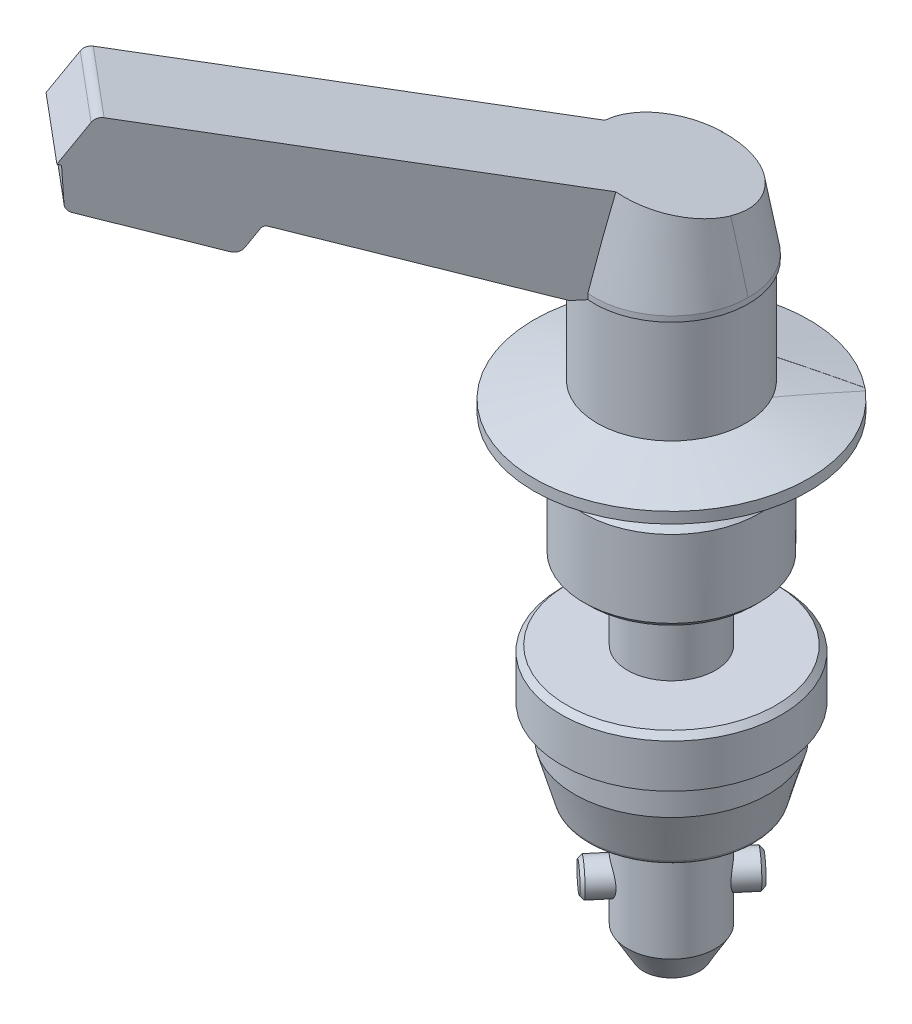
ISO-10303-21;
HEADER;
FILE_DESCRIPTION(('STEP AP214'),'2;1');
FILE_NAME('part.step','',(''),(''),'','','');
FILE_SCHEMA(('AUTOMOTIVE_DESIGN { 1 0 10303 214 1 1 1 1 }'));
ENDSEC;
DATA;
#1=APPLICATION_CONTEXT('core data for automotive mechanical design processes');
#2=APPLICATION_PROTOCOL_DEFINITION('international standard','automotive_design',2000,#1);
#3=PRODUCT_CONTEXT('',#1,'mechanical');
#4=PRODUCT('Part','Part','',(#3));
#5=PRODUCT_RELATED_PRODUCT_CATEGORY('part','',(#4));
#6=PRODUCT_DEFINITION_FORMATION('','',#4);
#7=PRODUCT_DEFINITION_CONTEXT('part definition',#1,'design');
#8=PRODUCT_DEFINITION('design','',#6,#7);
#9=PRODUCT_DEFINITION_SHAPE('','',#8);
#10=(LENGTH_UNIT() NAMED_UNIT(*) SI_UNIT(.MILLI.,.METRE.));
#11=(NAMED_UNIT(*) PLANE_ANGLE_UNIT() SI_UNIT($,.RADIAN.));
#12=(NAMED_UNIT(*) SI_UNIT($,.STERADIAN.) SOLID_ANGLE_UNIT());
#13=UNCERTAINTY_MEASURE_WITH_UNIT(LENGTH_MEASURE(1.E-05),#10,'distance_accuracy_value','');
#14=(GEOMETRIC_REPRESENTATION_CONTEXT(3) GLOBAL_UNCERTAINTY_ASSIGNED_CONTEXT((#13)) GLOBAL_UNIT_ASSIGNED_CONTEXT((#10,
#11,#12)) REPRESENTATION_CONTEXT('',''));
#15=CARTESIAN_POINT('',(0.,0.,0.));
#16=DIRECTION('',(0.,0.,1.));
#17=DIRECTION('',(1.,0.,0.));
#18=AXIS2_PLACEMENT_3D('',#15,#16,#17);
#19=CARTESIAN_POINT('',(0.,-14.62,0.));
#20=DIRECTION('',(0.,1.,0.));
#21=DIRECTION('',(0.,0.,1.));
#22=AXIS2_PLACEMENT_3D('',#19,#20,#21);
#23=CONICAL_SURFACE('',#22,7.466273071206,0.279252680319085);
#24=CARTESIAN_POINT('',(0.,-14.2578186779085,0.));
#25=DIRECTION('',(0.,-1.,0.));
#26=DIRECTION('',(0.,0.,-1.));
#27=AXIS2_PLACEMENT_3D('',#24,#25,#26);
#28=CIRCLE('',#27,7.57012689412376);
#29=CARTESIAN_POINT('',(0.,-14.2578186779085,-7.57012689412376));
#30=VERTEX_POINT('',#29);
#31=EDGE_CURVE('E1278',#30,#30,#28,.F.);
#32=ORIENTED_EDGE('',*,*,#31,.T.);
#33=EDGE_LOOP('',(#32));
#34=FACE_BOUND('',#33,.T.);
#35=CARTESIAN_POINT('',(0.,-9.96874144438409,0.));
#36=DIRECTION('',(0.,1.,0.));
#37=DIRECTION('',(0.,0.,1.));
#38=AXIS2_PLACEMENT_3D('',#35,#36,#37);
#39=CIRCLE('',#38,8.8);
#40=CARTESIAN_POINT('',(0.,-9.96874144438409,8.8));
#41=VERTEX_POINT('',#40);
#42=EDGE_CURVE('E425',#41,#41,#39,.F.);
#43=ORIENTED_EDGE('',*,*,#42,.T.);
#44=EDGE_LOOP('',(#43));
#45=FACE_BOUND('',#44,.T.);
#46=ADVANCED_FACE('F14',(#34,#45),#23,.T.);
#47=CARTESIAN_POINT('',(7.466273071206,-14.62,0.));
#48=DIRECTION('',(0.,-1.,0.));
#49=DIRECTION('',(0.,0.,-1.));
#50=AXIS2_PLACEMENT_3D('',#47,#48,#49);
#51=PLANE('',#50);
#52=CARTESIAN_POINT('',(0.,-14.62,0.));
#53=DIRECTION('',(0.,-1.,0.));
#54=DIRECTION('',(0.,0.,-1.));
#55=AXIS2_PLACEMENT_3D('',#52,#53,#54);
#56=CIRCLE('',#55,4.5);
#57=CARTESIAN_POINT('',(0.,-14.62,-4.5));
#58=VERTEX_POINT('',#57);
#59=EDGE_CURVE('E1281',#58,#58,#56,.F.);
#60=ORIENTED_EDGE('',*,*,#59,.T.);
#61=EDGE_LOOP('',(#60));
#62=FACE_BOUND('',#61,.T.);
#63=CARTESIAN_POINT('',(0.,-14.62,0.));
#64=DIRECTION('',(0.,-1.,0.));
#65=DIRECTION('',(0.,0.,-1.));
#66=AXIS2_PLACEMENT_3D('',#63,#64,#65);
#67=CIRCLE('',#66,7.0894960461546);
#68=CARTESIAN_POINT('',(0.,-14.62,-7.0894960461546));
#69=VERTEX_POINT('',#68);
#70=EDGE_CURVE('E1283',#69,#69,#67,.T.);
#71=ORIENTED_EDGE('',*,*,#70,.T.);
#72=EDGE_LOOP('',(#71));
#73=FACE_BOUND('',#72,.T.);
#74=ADVANCED_FACE('F325',(#62,#73),#51,.T.);
#75=CARTESIAN_POINT('',(0.,-2.1,0.));
#76=DIRECTION('',(0.,-1.,0.));
#77=DIRECTION('',(0.,0.,-1.));
#78=AXIS2_PLACEMENT_3D('',#75,#76,#77);
#79=CYLINDRICAL_SURFACE('',#78,10.);
#80=CARTESIAN_POINT('',(0.,-3.1,0.));
#81=DIRECTION('',(0.,-1.,0.));
#82=DIRECTION('',(0.,0.,-1.));
#83=AXIS2_PLACEMENT_3D('',#80,#81,#82);
#84=CIRCLE('',#83,10.);
#85=CARTESIAN_POINT('',(0.,-3.1,-10.));
#86=VERTEX_POINT('',#85);
#87=EDGE_CURVE('E1277',#86,#86,#84,.T.);
#88=ORIENTED_EDGE('',*,*,#87,.T.);
#89=EDGE_LOOP('',(#88));
#90=FACE_BOUND('',#89,.T.);
#91=CARTESIAN_POINT('',(0.,-7.05,0.));
#92=DIRECTION('',(0.,-1.,0.));
#93=DIRECTION('',(0.,0.,-1.));
#94=AXIS2_PLACEMENT_3D('',#91,#92,#93);
#95=CIRCLE('',#94,10.);
#96=CARTESIAN_POINT('',(0.,-7.05,-10.));
#97=VERTEX_POINT('',#96);
#98=EDGE_CURVE('E1294',#97,#97,#95,.T.);
#99=ORIENTED_EDGE('',*,*,#98,.F.);
#100=EDGE_LOOP('',(#99));
#101=FACE_BOUND('',#100,.T.);
#102=ADVANCED_FACE('F332',(#90,#101),#79,.T.);
#103=CARTESIAN_POINT('',(8.9,-7.05,0.));
#104=DIRECTION('',(0.,-1.,0.));
#105=DIRECTION('',(0.,0.,-1.));
#106=AXIS2_PLACEMENT_3D('',#103,#104,#105);
#107=PLANE('',#106);
#108=CARTESIAN_POINT('',(0.,-7.05,0.));
#109=DIRECTION('',(0.,-1.,0.));
#110=DIRECTION('',(0.,0.,-1.));
#111=AXIS2_PLACEMENT_3D('',#108,#109,#110);
#112=CIRCLE('',#111,9.2);
#113=CARTESIAN_POINT('',(0.,-7.05,-9.2));
#114=VERTEX_POINT('',#113);
#115=EDGE_CURVE('E24',#114,#114,#112,.F.);
#116=ORIENTED_EDGE('',*,*,#115,.T.);
#117=EDGE_LOOP('',(#116));
#118=FACE_BOUND('',#117,.T.);
#119=ORIENTED_EDGE('',*,*,#98,.T.);
#120=EDGE_LOOP('',(#119));
#121=FACE_BOUND('',#120,.T.);
#122=ADVANCED_FACE('F339',(#118,#121),#107,.T.);
#123=CARTESIAN_POINT('',(0.,-14.12,0.));
#124=DIRECTION('',(0.,-1.,0.));
#125=DIRECTION('',(0.,0.,-1.));
#126=AXIS2_PLACEMENT_3D('',#123,#124,#125);
#127=TOROIDAL_SURFACE('',#126,7.0894960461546,0.5);
#128=ORIENTED_EDGE('',*,*,#31,.F.);
#129=EDGE_LOOP('',(#128));
#130=FACE_BOUND('',#129,.T.);
#131=ORIENTED_EDGE('',*,*,#70,.F.);
#132=EDGE_LOOP('',(#131));
#133=FACE_BOUND('',#132,.T.);
#134=ADVANCED_FACE('F342',(#130,#133),#127,.T.);
#135=CARTESIAN_POINT('',(0.,-2.6,0.));
#136=DIRECTION('',(0.,-1.,0.));
#137=DIRECTION('',(0.,0.,-1.));
#138=AXIS2_PLACEMENT_3D('',#135,#136,#137);
#139=PLANE('',#138);
#140=CARTESIAN_POINT('',(0.,-2.6,0.));
#141=DIRECTION('',(0.,-1.,0.));
#142=DIRECTION('',(0.,0.,-1.));
#143=AXIS2_PLACEMENT_3D('',#140,#141,#142);
#144=CIRCLE('',#143,9.5);
#145=CARTESIAN_POINT('',(0.,-2.6,-9.5));
#146=VERTEX_POINT('',#145);
#147=EDGE_CURVE('E1206',#146,#146,#144,.F.);
#148=ORIENTED_EDGE('',*,*,#147,.T.);
#149=EDGE_LOOP('',(#148));
#150=FACE_BOUND('',#149,.T.);
#151=CARTESIAN_POINT('',(0.,-2.6,0.));
#152=DIRECTION('',(0.,-1.,0.));
#153=DIRECTION('',(0.,0.,-1.));
#154=AXIS2_PLACEMENT_3D('',#151,#152,#153);
#155=CIRCLE('',#154,4.);
#156=CARTESIAN_POINT('',(0.,-2.6,-4.));
#157=VERTEX_POINT('',#156);
#158=EDGE_CURVE('E18',#157,#157,#155,.F.);
#159=ORIENTED_EDGE('',*,*,#158,.F.);
#160=EDGE_LOOP('',(#159));
#161=FACE_BOUND('',#160,.T.);
#162=ADVANCED_FACE('F349',(#150,#161),#139,.F.);
#163=CARTESIAN_POINT('',(0.,-2.6,0.));
#164=DIRECTION('',(0.,-1.,0.));
#165=DIRECTION('',(0.,0.,-1.));
#166=AXIS2_PLACEMENT_3D('',#163,#164,#165);
#167=CONICAL_SURFACE('',#166,9.5,0.785398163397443);
#168=ORIENTED_EDGE('',*,*,#87,.F.);
#169=EDGE_LOOP('',(#168));
#170=FACE_BOUND('',#169,.T.);
#171=ORIENTED_EDGE('',*,*,#147,.F.);
#172=EDGE_LOOP('',(#171));
#173=FACE_BOUND('',#172,.T.);
#174=ADVANCED_FACE('F351',(#170,#173),#167,.T.);
#175=CARTESIAN_POINT('',(0.,-14.62,0.));
#176=DIRECTION('',(0.,-1.,0.));
#177=DIRECTION('',(0.,0.,-1.));
#178=AXIS2_PLACEMENT_3D('',#175,#176,#177);
#179=CONICAL_SURFACE('',#178,4.5,0.785398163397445);
#180=CARTESIAN_POINT('',(0.,-14.12,0.));
#181=DIRECTION('',(0.,-1.,0.));
#182=DIRECTION('',(0.,0.,-1.));
#183=AXIS2_PLACEMENT_3D('',#180,#181,#182);
#184=CIRCLE('',#183,4.);
#185=CARTESIAN_POINT('',(0.,-14.12,-4.));
#186=VERTEX_POINT('',#185);
#187=EDGE_CURVE('E1289',#186,#186,#184,.T.);
#188=ORIENTED_EDGE('',*,*,#187,.F.);
#189=EDGE_LOOP('',(#188));
#190=FACE_BOUND('',#189,.T.);
#191=ORIENTED_EDGE('',*,*,#59,.F.);
#192=EDGE_LOOP('',(#191));
#193=FACE_BOUND('',#192,.T.);
#194=ADVANCED_FACE('F354',(#190,#193),#179,.F.);
#195=CARTESIAN_POINT('',(0.,-2.1,0.));
#196=DIRECTION('',(0.,1.,0.));
#197=DIRECTION('',(0.,0.,1.));
#198=AXIS2_PLACEMENT_3D('',#195,#196,#197);
#199=CYLINDRICAL_SURFACE('',#198,8.8);
#200=CARTESIAN_POINT('',(0.,-7.45,0.));
#201=DIRECTION('',(0.,-1.,0.));
#202=DIRECTION('',(0.,0.,-1.));
#203=AXIS2_PLACEMENT_3D('',#200,#201,#202);
#204=CIRCLE('',#203,8.8);
#205=CARTESIAN_POINT('',(0.,-7.45,-8.8));
#206=VERTEX_POINT('',#205);
#207=EDGE_CURVE('E9',#206,#206,#204,.T.);
#208=ORIENTED_EDGE('',*,*,#207,.T.);
#209=EDGE_LOOP('',(#208));
#210=FACE_BOUND('',#209,.T.);
#211=ORIENTED_EDGE('',*,*,#42,.F.);
#212=EDGE_LOOP('',(#211));
#213=FACE_BOUND('',#212,.T.);
#214=ADVANCED_FACE('F358',(#210,#213),#199,.T.);
#215=CARTESIAN_POINT('',(0.,-7.45,0.));
#216=DIRECTION('',(0.,-1.,0.));
#217=DIRECTION('',(0.,0.,-1.));
#218=AXIS2_PLACEMENT_3D('',#215,#216,#217);
#219=TOROIDAL_SURFACE('',#218,9.2,0.4);
#220=ORIENTED_EDGE('',*,*,#207,.F.);
#221=EDGE_LOOP('',(#220));
#222=FACE_BOUND('',#221,.T.);
#223=ORIENTED_EDGE('',*,*,#115,.F.);
#224=EDGE_LOOP('',(#223));
#225=FACE_BOUND('',#224,.T.);
#226=ADVANCED_FACE('F360',(#222,#225),#219,.F.);
#227=CARTESIAN_POINT('',(0.663413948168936,-24.8080036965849,0.556670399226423));
#228=DIRECTION('',(0.,-1.,0.));
#229=DIRECTION('',(0.642787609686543,0.,-0.766044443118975));
#230=AXIS2_PLACEMENT_3D('',#227,#228,#229);
#231=PLANE('',#230);
#232=DIRECTION('',(-0.173648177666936,0.,0.984807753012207));
#233=VECTOR('',#232,1.);
#234=CARTESIAN_POINT('',(0.813797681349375,-24.8080036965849,-0.296198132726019));
#235=LINE('',#234,#233);
#236=CARTESIAN_POINT('',(0.813797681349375,-24.8080036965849,-0.296198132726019));
#237=VERTEX_POINT('',#236);
#238=CARTESIAN_POINT('',(0.663413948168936,-24.8080036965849,0.556670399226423));
#239=VERTEX_POINT('',#238);
#240=EDGE_CURVE('E196',#237,#239,#235,.T.);
#241=ORIENTED_EDGE('',*,*,#240,.T.);
#242=DIRECTION('',(-0.93969262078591,0.,0.342020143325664));
#243=VECTOR('',#242,1.);
#244=CARTESIAN_POINT('',(0.663413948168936,-24.8080036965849,0.556670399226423));
#245=LINE('',#244,#243);
#246=CARTESIAN_POINT('',(-0.15038373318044,-24.8080036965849,0.852868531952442));
#247=VERTEX_POINT('',#246);
#248=EDGE_CURVE('E1365',#239,#247,#245,.T.);
#249=ORIENTED_EDGE('',*,*,#248,.T.);
#250=DIRECTION('',(-0.766044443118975,0.,-0.642787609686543));
#251=VECTOR('',#250,1.);
#252=CARTESIAN_POINT('',(-0.15038373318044,-24.8080036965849,0.852868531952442));
#253=LINE('',#252,#251);
#254=CARTESIAN_POINT('',(-0.813797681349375,-24.8080036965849,0.296198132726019));
#255=VERTEX_POINT('',#254);
#256=EDGE_CURVE('E1367',#247,#255,#253,.T.);
#257=ORIENTED_EDGE('',*,*,#256,.T.);
#258=DIRECTION('',(0.173648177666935,0.,-0.984807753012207));
#259=VECTOR('',#258,1.);
#260=CARTESIAN_POINT('',(-0.813797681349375,-24.8080036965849,0.296198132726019));
#261=LINE('',#260,#259);
#262=CARTESIAN_POINT('',(-0.663413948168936,-24.8080036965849,-0.556670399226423));
#263=VERTEX_POINT('',#262);
#264=EDGE_CURVE('E1371',#255,#263,#261,.T.);
#265=ORIENTED_EDGE('',*,*,#264,.T.);
#266=DIRECTION('',(0.93969262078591,0.,-0.342020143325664));
#267=VECTOR('',#266,1.);
#268=CARTESIAN_POINT('',(-0.663413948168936,-24.8080036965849,-0.556670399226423));
#269=LINE('',#268,#267);
#270=CARTESIAN_POINT('',(0.150383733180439,-24.8080036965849,-0.852868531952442));
#271=VERTEX_POINT('',#270);
#272=EDGE_CURVE('E1373',#263,#271,#269,.T.);
#273=ORIENTED_EDGE('',*,*,#272,.T.);
#274=DIRECTION('',(0.766044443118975,0.,0.642787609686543));
#275=VECTOR('',#274,1.);
#276=CARTESIAN_POINT('',(0.150383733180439,-24.8080036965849,-0.852868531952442));
#277=LINE('',#276,#275);
#278=EDGE_CURVE('E225',#271,#237,#277,.T.);
#279=ORIENTED_EDGE('',*,*,#278,.T.);
#280=EDGE_LOOP('',(#241,#249,#257,#265,#273,#279));
#281=FACE_BOUND('',#280,.T.);
#282=ADVANCED_FACE('F363',(#281),#231,.T.);
#283=CARTESIAN_POINT('',(0.663413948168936,-24.8080036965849,0.556670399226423));
#284=DIRECTION('',(0.342020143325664,0.,0.93969262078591));
#285=DIRECTION('',(-0.93969262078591,0.,0.342020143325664));
#286=AXIS2_PLACEMENT_3D('',#283,#284,#285);
#287=PLANE('',#286);
#288=DIRECTION('',(-0.93969262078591,0.,0.342020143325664));
#289=VECTOR('',#288,1.);
#290=CARTESIAN_POINT('',(0.663413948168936,-26.0080036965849,0.556670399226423));
#291=LINE('',#290,#289);
#292=CARTESIAN_POINT('',(0.663413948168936,-26.0080036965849,0.556670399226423));
#293=VERTEX_POINT('',#292);
#294=CARTESIAN_POINT('',(-0.15038373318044,-26.0080036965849,0.852868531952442));
#295=VERTEX_POINT('',#294);
#296=EDGE_CURVE('E216',#293,#295,#291,.T.);
#297=ORIENTED_EDGE('',*,*,#296,.T.);
#298=DIRECTION('',(0.,-1.,0.));
#299=VECTOR('',#298,1.);
#300=CARTESIAN_POINT('',(-0.15038373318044,-24.8080036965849,0.852868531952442));
#301=LINE('',#300,#299);
#302=EDGE_CURVE('E239',#247,#295,#301,.T.);
#303=ORIENTED_EDGE('',*,*,#302,.F.);
#304=ORIENTED_EDGE('',*,*,#248,.F.);
#305=DIRECTION('',(0.,-1.,0.));
#306=VECTOR('',#305,1.);
#307=CARTESIAN_POINT('',(0.663413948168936,-24.8080036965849,0.556670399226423));
#308=LINE('',#307,#306);
#309=EDGE_CURVE('E241',#239,#293,#308,.T.);
#310=ORIENTED_EDGE('',*,*,#309,.T.);
#311=EDGE_LOOP('',(#297,#303,#304,#310));
#312=FACE_BOUND('',#311,.T.);
#313=ADVANCED_FACE('F1098',(#312),#287,.F.);
#314=CARTESIAN_POINT('',(-0.15038373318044,-24.8080036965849,0.852868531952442));
#315=DIRECTION('',(-0.642787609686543,0.,0.766044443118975));
#316=DIRECTION('',(-0.766044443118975,0.,-0.642787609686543));
#317=AXIS2_PLACEMENT_3D('',#314,#315,#316);
#318=PLANE('',#317);
#319=DIRECTION('',(-0.766044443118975,0.,-0.642787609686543));
#320=VECTOR('',#319,1.);
#321=CARTESIAN_POINT('',(-0.15038373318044,-26.0080036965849,0.852868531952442));
#322=LINE('',#321,#320);
#323=CARTESIAN_POINT('',(-0.813797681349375,-26.0080036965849,0.296198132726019));
#324=VERTEX_POINT('',#323);
#325=EDGE_CURVE('E219',#295,#324,#322,.T.);
#326=ORIENTED_EDGE('',*,*,#325,.T.);
#327=DIRECTION('',(0.,-1.,0.));
#328=VECTOR('',#327,1.);
#329=CARTESIAN_POINT('',(-0.813797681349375,-24.8080036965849,0.296198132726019));
#330=LINE('',#329,#328);
#331=EDGE_CURVE('E237',#255,#324,#330,.T.);
#332=ORIENTED_EDGE('',*,*,#331,.F.);
#333=ORIENTED_EDGE('',*,*,#256,.F.);
#334=ORIENTED_EDGE('',*,*,#302,.T.);
#335=EDGE_LOOP('',(#326,#332,#333,#334));
#336=FACE_BOUND('',#335,.T.);
#337=ADVANCED_FACE('F1103',(#336),#318,.F.);
#338=CARTESIAN_POINT('',(-0.813797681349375,-24.8080036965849,0.296198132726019));
#339=DIRECTION('',(-0.984807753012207,0.,-0.173648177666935));
#340=DIRECTION('',(0.173648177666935,0.,-0.984807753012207));
#341=AXIS2_PLACEMENT_3D('',#338,#339,#340);
#342=PLANE('',#341);
#343=DIRECTION('',(0.173648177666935,0.,-0.984807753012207));
#344=VECTOR('',#343,1.);
#345=CARTESIAN_POINT('',(-0.813797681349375,-26.0080036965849,0.296198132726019));
#346=LINE('',#345,#344);
#347=CARTESIAN_POINT('',(-0.663413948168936,-26.0080036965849,-0.556670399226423));
#348=VERTEX_POINT('',#347);
#349=EDGE_CURVE('E230',#324,#348,#346,.T.);
#350=ORIENTED_EDGE('',*,*,#349,.T.);
#351=DIRECTION('',(0.,-1.,0.));
#352=VECTOR('',#351,1.);
#353=CARTESIAN_POINT('',(-0.663413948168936,-24.8080036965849,-0.556670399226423));
#354=LINE('',#353,#352);
#355=EDGE_CURVE('E235',#263,#348,#354,.T.);
#356=ORIENTED_EDGE('',*,*,#355,.F.);
#357=ORIENTED_EDGE('',*,*,#264,.F.);
#358=ORIENTED_EDGE('',*,*,#331,.T.);
#359=EDGE_LOOP('',(#350,#356,#357,#358));
#360=FACE_BOUND('',#359,.T.);
#361=ADVANCED_FACE('F1115',(#360),#342,.F.);
#362=CARTESIAN_POINT('',(-0.663413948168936,-24.8080036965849,-0.556670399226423));
#363=DIRECTION('',(-0.342020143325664,0.,-0.93969262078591));
#364=DIRECTION('',(0.93969262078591,0.,-0.342020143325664));
#365=AXIS2_PLACEMENT_3D('',#362,#363,#364);
#366=PLANE('',#365);
#367=DIRECTION('',(0.93969262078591,0.,-0.342020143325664));
#368=VECTOR('',#367,1.);
#369=CARTESIAN_POINT('',(-0.663413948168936,-26.0080036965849,-0.556670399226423));
#370=LINE('',#369,#368);
#371=CARTESIAN_POINT('',(0.150383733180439,-26.0080036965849,-0.852868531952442));
#372=VERTEX_POINT('',#371);
#373=EDGE_CURVE('E209',#348,#372,#370,.T.);
#374=ORIENTED_EDGE('',*,*,#373,.T.);
#375=DIRECTION('',(0.,-1.,0.));
#376=VECTOR('',#375,1.);
#377=CARTESIAN_POINT('',(0.150383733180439,-24.8080036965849,-0.852868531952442));
#378=LINE('',#377,#376);
#379=EDGE_CURVE('E201',#271,#372,#378,.T.);
#380=ORIENTED_EDGE('',*,*,#379,.F.);
#381=ORIENTED_EDGE('',*,*,#272,.F.);
#382=ORIENTED_EDGE('',*,*,#355,.T.);
#383=EDGE_LOOP('',(#374,#380,#381,#382));
#384=FACE_BOUND('',#383,.T.);
#385=ADVANCED_FACE('F1091',(#384),#366,.F.);
#386=CARTESIAN_POINT('',(0.150383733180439,-24.8080036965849,-0.852868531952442));
#387=DIRECTION('',(0.642787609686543,0.,-0.766044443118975));
#388=DIRECTION('',(0.766044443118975,0.,0.642787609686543));
#389=AXIS2_PLACEMENT_3D('',#386,#387,#388);
#390=PLANE('',#389);
#391=DIRECTION('',(0.766044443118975,0.,0.642787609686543));
#392=VECTOR('',#391,1.);
#393=CARTESIAN_POINT('',(0.150383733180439,-26.0080036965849,-0.852868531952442));
#394=LINE('',#393,#392);
#395=CARTESIAN_POINT('',(0.813797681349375,-26.0080036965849,-0.296198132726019));
#396=VERTEX_POINT('',#395);
#397=EDGE_CURVE('E204',#372,#396,#394,.T.);
#398=ORIENTED_EDGE('',*,*,#397,.T.);
#399=DIRECTION('',(0.,-1.,0.));
#400=VECTOR('',#399,1.);
#401=CARTESIAN_POINT('',(0.813797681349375,-24.8080036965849,-0.296198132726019));
#402=LINE('',#401,#400);
#403=EDGE_CURVE('E189',#237,#396,#402,.T.);
#404=ORIENTED_EDGE('',*,*,#403,.F.);
#405=ORIENTED_EDGE('',*,*,#278,.F.);
#406=ORIENTED_EDGE('',*,*,#379,.T.);
#407=EDGE_LOOP('',(#398,#404,#405,#406));
#408=FACE_BOUND('',#407,.T.);
#409=ADVANCED_FACE('F205',(#408),#390,.F.);
#410=CARTESIAN_POINT('',(0.813797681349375,-24.8080036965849,-0.296198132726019));
#411=DIRECTION('',(0.984807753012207,0.,0.173648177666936));
#412=DIRECTION('',(-0.173648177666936,0.,0.984807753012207));
#413=AXIS2_PLACEMENT_3D('',#410,#411,#412);
#414=PLANE('',#413);
#415=DIRECTION('',(-0.173648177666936,0.,0.984807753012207));
#416=VECTOR('',#415,1.);
#417=CARTESIAN_POINT('',(0.813797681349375,-26.0080036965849,-0.296198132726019));
#418=LINE('',#417,#416);
#419=EDGE_CURVE('E193',#396,#293,#418,.T.);
#420=ORIENTED_EDGE('',*,*,#419,.T.);
#421=ORIENTED_EDGE('',*,*,#309,.F.);
#422=ORIENTED_EDGE('',*,*,#240,.F.);
#423=ORIENTED_EDGE('',*,*,#403,.T.);
#424=EDGE_LOOP('',(#420,#421,#422,#423));
#425=FACE_BOUND('',#424,.T.);
#426=ADVANCED_FACE('F191',(#425),#414,.F.);
#427=CARTESIAN_POINT('',(0.,-26.0080036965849,0.));
#428=DIRECTION('',(0.,-1.,0.));
#429=DIRECTION('',(0.642787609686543,0.,-0.766044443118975));
#430=AXIS2_PLACEMENT_3D('',#427,#428,#429);
#431=PLANE('',#430);
#432=ORIENTED_EDGE('',*,*,#419,.F.);
#433=ORIENTED_EDGE('',*,*,#397,.F.);
#434=ORIENTED_EDGE('',*,*,#373,.F.);
#435=ORIENTED_EDGE('',*,*,#349,.F.);
#436=ORIENTED_EDGE('',*,*,#325,.F.);
#437=ORIENTED_EDGE('',*,*,#296,.F.);
#438=EDGE_LOOP('',(#432,#433,#434,#435,#436,#437));
#439=FACE_BOUND('',#438,.T.);
#440=CARTESIAN_POINT('',(0.,-26.0080036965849,0.));
#441=DIRECTION('',(0.,-1.,0.));
#442=DIRECTION('',(0.,0.,-1.));
#443=AXIS2_PLACEMENT_3D('',#440,#441,#442);
#444=CIRCLE('',#443,1.25);
#445=CARTESIAN_POINT('',(0.,-26.0080036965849,-1.25));
#446=VERTEX_POINT('',#445);
#447=EDGE_CURVE('E200',#446,#446,#444,.T.);
#448=ORIENTED_EDGE('',*,*,#447,.T.);
#449=EDGE_LOOP('',(#448));
#450=FACE_BOUND('',#449,.T.);
#451=ADVANCED_FACE('F212',(#439,#450),#431,.T.);
#452=CARTESIAN_POINT('',(0.,-27.008003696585,0.));
#453=DIRECTION('',(0.,-1.,0.));
#454=DIRECTION('',(-0.766044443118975,0.,-0.642787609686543));
#455=AXIS2_PLACEMENT_3D('',#452,#453,#454);
#456=CYLINDRICAL_SURFACE('',#455,1.25);
#457=ORIENTED_EDGE('',*,*,#447,.F.);
#458=EDGE_LOOP('',(#457));
#459=FACE_BOUND('',#458,.T.);
#460=CARTESIAN_POINT('',(0.,-26.5080036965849,0.));
#461=DIRECTION('',(0.,-1.,0.));
#462=DIRECTION('',(-0.766044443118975,0.,-0.642787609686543));
#463=AXIS2_PLACEMENT_3D('',#460,#461,#462);
#464=CIRCLE('',#463,1.25);
#465=CARTESIAN_POINT('',(-0.957555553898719,-26.5080036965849,-0.803484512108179));
#466=VERTEX_POINT('',#465);
#467=EDGE_CURVE('E1212',#466,#466,#464,.T.);
#468=ORIENTED_EDGE('',*,*,#467,.T.);
#469=EDGE_LOOP('',(#468));
#470=FACE_BOUND('',#469,.T.);
#471=ADVANCED_FACE('F1018',(#459,#470),#456,.F.);
#472=CARTESIAN_POINT('',(3.85672565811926,-20.508003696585,-4.59626665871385));
#473=DIRECTION('',(-0.642787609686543,0.,0.766044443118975));
#474=DIRECTION('',(0.766044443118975,0.,0.642787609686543));
#475=AXIS2_PLACEMENT_3D('',#472,#473,#474);
#476=PLANE('',#475);
#477=CARTESIAN_POINT('',(3.85672565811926,-20.508003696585,-4.59626665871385));
#478=DIRECTION('',(-0.642787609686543,0.,0.766044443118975));
#479=DIRECTION('',(0.766044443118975,0.,0.642787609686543));
#480=AXIS2_PLACEMENT_3D('',#477,#478,#479);
#481=CIRCLE('',#480,1.2);
#482=CARTESIAN_POINT('',(4.77597898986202,-20.508003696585,-3.82492152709));
#483=VERTEX_POINT('',#482);
#484=EDGE_CURVE('E253',#483,#483,#481,.F.);
#485=ORIENTED_EDGE('',*,*,#484,.T.);
#486=EDGE_LOOP('',(#485));
#487=FACE_BOUND('',#486,.T.);
#488=ADVANCED_FACE('F1044',(#487),#476,.F.);
#489=CARTESIAN_POINT('',(0.,-27.008003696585,0.));
#490=DIRECTION('',(0.,-1.,0.));
#491=DIRECTION('',(-0.766044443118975,0.,-0.642787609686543));
#492=AXIS2_PLACEMENT_3D('',#489,#490,#491);
#493=CONICAL_SURFACE('',#492,1.75,0.78539816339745);
#494=ORIENTED_EDGE('',*,*,#467,.F.);
#495=EDGE_LOOP('',(#494));
#496=FACE_BOUND('',#495,.T.);
#497=CARTESIAN_POINT('',(0.,-27.008003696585,0.));
#498=DIRECTION('',(0.,-1.,0.));
#499=DIRECTION('',(-0.766044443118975,0.,-0.642787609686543));
#500=AXIS2_PLACEMENT_3D('',#497,#498,#499);
#501=CIRCLE('',#500,1.75);
#502=CARTESIAN_POINT('',(-1.34057777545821,-27.008003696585,-1.12487831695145));
#503=VERTEX_POINT('',#502);
#504=EDGE_CURVE('E1210',#503,#503,#501,.T.);
#505=ORIENTED_EDGE('',*,*,#504,.T.);
#506=EDGE_LOOP('',(#505));
#507=FACE_BOUND('',#506,.T.);
#508=ADVANCED_FACE('F1024',(#496,#507),#493,.F.);
#509=CARTESIAN_POINT('',(-3.85672565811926,-20.508003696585,4.59626665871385));
#510=DIRECTION('',(-0.642787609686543,0.,0.766044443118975));
#511=DIRECTION('',(0.766044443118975,0.,0.642787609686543));
#512=AXIS2_PLACEMENT_3D('',#509,#510,#511);
#513=PLANE('',#512);
#514=CARTESIAN_POINT('',(-3.85672565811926,-20.508003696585,4.59626665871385));
#515=DIRECTION('',(-0.642787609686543,0.,0.766044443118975));
#516=DIRECTION('',(0.766044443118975,0.,0.642787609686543));
#517=AXIS2_PLACEMENT_3D('',#514,#515,#516);
#518=CIRCLE('',#517,1.2);
#519=CARTESIAN_POINT('',(-2.93747232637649,-20.508003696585,5.3676117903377));
#520=VERTEX_POINT('',#519);
#521=EDGE_CURVE('E256',#520,#520,#518,.T.);
#522=ORIENTED_EDGE('',*,*,#521,.T.);
#523=EDGE_LOOP('',(#522));
#524=FACE_BOUND('',#523,.T.);
#525=ADVANCED_FACE('F927',(#524),#513,.T.);
#526=CARTESIAN_POINT('',(3.66388937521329,-20.508003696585,-4.36645332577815));
#527=DIRECTION('',(-0.642787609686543,0.,0.766044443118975));
#528=DIRECTION('',(0.766044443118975,0.,0.642787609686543));
#529=AXIS2_PLACEMENT_3D('',#526,#527,#528);
#530=CONICAL_SURFACE('',#529,1.5,0.785398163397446);
#531=ORIENTED_EDGE('',*,*,#484,.F.);
#532=EDGE_LOOP('',(#531));
#533=FACE_BOUND('',#532,.T.);
#534=CARTESIAN_POINT('',(3.66388937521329,-20.508003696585,-4.36645332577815));
#535=DIRECTION('',(-0.642787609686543,0.,0.766044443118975));
#536=DIRECTION('',(0.766044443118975,0.,0.642787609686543));
#537=AXIS2_PLACEMENT_3D('',#534,#535,#536);
#538=CIRCLE('',#537,1.5);
#539=CARTESIAN_POINT('',(4.81295603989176,-20.508003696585,-3.40227191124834));
#540=VERTEX_POINT('',#539);
#541=EDGE_CURVE('E249',#540,#540,#538,.T.);
#542=ORIENTED_EDGE('',*,*,#541,.F.);
#543=EDGE_LOOP('',(#542));
#544=FACE_BOUND('',#543,.T.);
#545=ADVANCED_FACE('F1019',(#533,#544),#530,.T.);
#546=CARTESIAN_POINT('',(0.,-27.008003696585,0.));
#547=DIRECTION('',(0.,-1.,0.));
#548=DIRECTION('',(-0.766044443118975,0.,-0.642787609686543));
#549=AXIS2_PLACEMENT_3D('',#546,#547,#548);
#550=PLANE('',#549);
#551=ORIENTED_EDGE('',*,*,#504,.F.);
#552=EDGE_LOOP('',(#551));
#553=FACE_BOUND('',#552,.T.);
#554=CARTESIAN_POINT('',(0.,-27.008003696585,0.));
#555=DIRECTION('',(0.,-1.,0.));
#556=DIRECTION('',(-0.766044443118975,0.,-0.642787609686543));
#557=AXIS2_PLACEMENT_3D('',#554,#555,#556);
#558=CIRCLE('',#557,2.55662432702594);
#559=CARTESIAN_POINT('',(-1.95848785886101,-27.008003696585,-1.64336644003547));
#560=VERTEX_POINT('',#559);
#561=EDGE_CURVE('E1216',#560,#560,#558,.T.);
#562=ORIENTED_EDGE('',*,*,#561,.T.);
#563=EDGE_LOOP('',(#562));
#564=FACE_BOUND('',#563,.T.);
#565=ADVANCED_FACE('F281',(#553,#564),#550,.T.);
#566=CARTESIAN_POINT('',(-3.85672565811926,-20.508003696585,4.59626665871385));
#567=DIRECTION('',(0.642787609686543,0.,-0.766044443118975));
#568=DIRECTION('',(-0.766044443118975,0.,-0.642787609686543));
#569=AXIS2_PLACEMENT_3D('',#566,#567,#568);
#570=CONICAL_SURFACE('',#569,1.2,0.785398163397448);
#571=CARTESIAN_POINT('',(-3.66388937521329,-20.508003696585,4.36645332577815));
#572=DIRECTION('',(-0.642787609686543,0.,0.766044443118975));
#573=DIRECTION('',(0.766044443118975,0.,0.642787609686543));
#574=AXIS2_PLACEMENT_3D('',#571,#572,#573);
#575=CIRCLE('',#574,1.5);
#576=CARTESIAN_POINT('',(-2.51482271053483,-20.508003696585,5.33063474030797));
#577=VERTEX_POINT('',#576);
#578=EDGE_CURVE('E246',#577,#577,#575,.F.);
#579=ORIENTED_EDGE('',*,*,#578,.F.);
#580=EDGE_LOOP('',(#579));
#581=FACE_BOUND('',#580,.T.);
#582=ORIENTED_EDGE('',*,*,#521,.F.);
#583=EDGE_LOOP('',(#582));
#584=FACE_BOUND('',#583,.T.);
#585=ADVANCED_FACE('F933',(#581,#584),#570,.T.);
#586=CARTESIAN_POINT('',(-3.85672565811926,-20.508003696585,4.59626665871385));
#587=DIRECTION('',(0.642787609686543,0.,-0.766044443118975));
#588=DIRECTION('',(-0.766044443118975,0.,-0.642787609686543));
#589=AXIS2_PLACEMENT_3D('',#586,#587,#588);
#590=CYLINDRICAL_SURFACE('',#589,1.5);
#591=CARTESIAN_POINT('',(1.23445358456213,-20.508003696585,-3.80475023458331));
#592=CARTESIAN_POINT('',(1.23444943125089,-20.4269962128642,-3.80475001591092));
#593=CARTESIAN_POINT('',(1.24122206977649,-20.3460087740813,-3.80257367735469));
#594=CARTESIAN_POINT('',(1.26785215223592,-20.1864756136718,-3.79377719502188));
#595=CARTESIAN_POINT('',(1.28770920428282,-20.10792981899,-3.78715718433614));
#596=CARTESIAN_POINT('',(1.33924688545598,-19.9556283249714,-3.76923757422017));
#597=CARTESIAN_POINT('',(1.37089918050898,-19.8818616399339,-3.75794918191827));
#598=CARTESIAN_POINT('',(1.44440662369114,-19.7406317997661,-3.73031184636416));
#599=CARTESIAN_POINT('',(1.48626483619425,-19.6731705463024,-3.71396138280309));
#600=CARTESIAN_POINT('',(1.58046770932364,-19.5431133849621,-3.67489211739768));
#601=CARTESIAN_POINT('',(1.6332008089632,-19.4808751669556,-3.65191889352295));
#602=CARTESIAN_POINT('',(1.74573032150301,-19.3662808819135,-3.59948265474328));
#603=CARTESIAN_POINT('',(1.80552823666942,-19.3139269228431,-3.57001825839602));
#604=CARTESIAN_POINT('',(1.93212883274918,-19.2188641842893,-3.50316523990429));
#605=CARTESIAN_POINT('',(1.99910062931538,-19.1765442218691,-3.46554109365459));
#606=CARTESIAN_POINT('',(2.13569673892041,-19.10535252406,-3.38306830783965));
#607=CARTESIAN_POINT('',(2.20532012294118,-19.076476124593,-3.3382221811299));
#608=CARTESIAN_POINT('',(2.34154895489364,-19.0342458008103,-3.24402629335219));
#609=CARTESIAN_POINT('',(2.40815504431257,-19.0202760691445,-3.19495422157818));
#610=CARTESIAN_POINT('',(2.53903232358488,-19.00628249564,-3.0919637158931));
#611=CARTESIAN_POINT('',(2.60330426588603,-19.0062541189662,-3.0380468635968));
#612=CARTESIAN_POINT('',(2.72439406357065,-19.0197854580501,-2.92983772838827));
#613=CARTESIAN_POINT('',(2.78142338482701,-19.0326729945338,-2.87569598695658));
#614=CARTESIAN_POINT('',(2.89019530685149,-19.0705396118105,-2.76635518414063));
#615=CARTESIAN_POINT('',(2.94193753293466,-19.095519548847,-2.71115604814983));
#616=CARTESIAN_POINT('',(3.0399654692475,-19.1571741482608,-2.60079630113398));
#617=CARTESIAN_POINT('',(3.08616081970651,-19.1940137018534,-2.5456479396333));
#618=CARTESIAN_POINT('',(3.17176129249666,-19.2781957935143,-2.43816694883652));
#619=CARTESIAN_POINT('',(3.21116421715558,-19.3255417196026,-2.38583523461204));
#620=CARTESIAN_POINT('',(3.28514776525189,-19.4326309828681,-2.28299158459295));
#621=CARTESIAN_POINT('',(3.31931133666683,-19.4929376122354,-2.23276528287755));
#622=CARTESIAN_POINT('',(3.37994479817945,-19.6225966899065,-2.13987319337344));
#623=CARTESIAN_POINT('',(3.40641275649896,-19.6919514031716,-2.09720930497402));
#624=CARTESIAN_POINT('',(3.45229497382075,-19.8397231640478,-2.02081565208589));
#625=CARTESIAN_POINT('',(3.47153962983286,-19.918307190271,-1.98730520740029));
#626=CARTESIAN_POINT('',(3.50224273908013,-20.0810999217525,-1.93268962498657));
#627=CARTESIAN_POINT('',(3.5137055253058,-20.1653054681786,-1.91157758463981));
#628=CARTESIAN_POINT('',(3.52850251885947,-20.3319796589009,-1.88411819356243));
#629=CARTESIAN_POINT('',(3.53225031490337,-20.4142878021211,-1.87702048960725));
#630=CARTESIAN_POINT('',(3.53288002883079,-20.5790130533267,-1.87583618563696));
#631=CARTESIAN_POINT('',(3.52976366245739,-20.6614301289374,-1.88174633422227));
#632=CARTESIAN_POINT('',(3.51697010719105,-20.8199336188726,-1.90554088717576));
#633=CARTESIAN_POINT('',(3.50761137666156,-20.8961348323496,-1.92284356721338));
#634=CARTESIAN_POINT('',(3.48261843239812,-21.0443516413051,-1.96774600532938));
#635=CARTESIAN_POINT('',(3.46698293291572,-21.1163663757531,-1.99534787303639));
#636=CARTESIAN_POINT('',(3.42864780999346,-21.2571681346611,-2.06054637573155));
#637=CARTESIAN_POINT('',(3.40570536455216,-21.3257329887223,-2.09847887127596));
#638=CARTESIAN_POINT('',(3.35285046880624,-21.455132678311,-2.18193267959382));
#639=CARTESIAN_POINT('',(3.32293546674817,-21.5159646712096,-2.22745676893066));
#640=CARTESIAN_POINT('',(3.25390905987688,-21.63217206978,-2.32722533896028));
#641=CARTESIAN_POINT('',(3.21433488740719,-21.6869571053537,-2.38183968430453));
#642=CARTESIAN_POINT('',(3.12724286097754,-21.7848420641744,-2.49508472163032));
#643=CARTESIAN_POINT('',(3.07972498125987,-21.8279419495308,-2.55371542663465));
#644=CARTESIAN_POINT('',(2.97734502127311,-21.9009497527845,-2.67236370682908));
#645=CARTESIAN_POINT('',(2.92250893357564,-21.9309028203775,-2.73237577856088));
#646=CARTESIAN_POINT('',(2.80637181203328,-21.9766601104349,-2.85152298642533));
#647=CARTESIAN_POINT('',(2.74507383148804,-21.9924709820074,-2.91065852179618));
#648=CARTESIAN_POINT('',(2.6213829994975,-22.0087780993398,-3.02239848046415));
#649=CARTESIAN_POINT('',(2.55926215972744,-22.0101131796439,-3.07518267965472));
#650=CARTESIAN_POINT('',(2.43259531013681,-21.9995885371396,-3.17632585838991));
#651=CARTESIAN_POINT('',(2.36804959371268,-21.9877304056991,-3.22468537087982));
#652=CARTESIAN_POINT('',(2.24022507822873,-21.9517448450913,-3.31471887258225));
#653=CARTESIAN_POINT('',(2.17695378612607,-21.9279237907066,-3.35652717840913));
#654=CARTESIAN_POINT('',(2.05209943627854,-21.8689936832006,-3.43428343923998));
#655=CARTESIAN_POINT('',(1.99051670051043,-21.8338824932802,-3.47023028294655));
#656=CARTESIAN_POINT('',(1.86845881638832,-21.7516897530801,-3.53750233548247));
#657=CARTESIAN_POINT('',(1.80813904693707,-21.7041670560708,-3.56856974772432));
#658=CARTESIAN_POINT('',(1.69349337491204,-21.5991958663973,-3.62438308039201));
#659=CARTESIAN_POINT('',(1.63916962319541,-21.5417438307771,-3.64912673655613));
#660=CARTESIAN_POINT('',(1.5358666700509,-21.4149395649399,-3.69383951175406));
#661=CARTESIAN_POINT('',(1.48732087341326,-21.3451192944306,-3.71348770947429));
#662=CARTESIAN_POINT('',(1.40138910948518,-21.1975878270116,-3.74676393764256));
#663=CARTESIAN_POINT('',(1.36400430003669,-21.1198758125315,-3.76039134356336));
#664=CARTESIAN_POINT('',(1.30117106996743,-20.9550480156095,-3.78260828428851));
#665=CARTESIAN_POINT('',(1.27631779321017,-20.8676693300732,-3.79095076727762));
#666=CARTESIAN_POINT('',(1.24296677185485,-20.6895184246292,-3.80202001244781));
#667=CARTESIAN_POINT('',(1.23445823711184,-20.598748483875,-3.80475047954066));
#668=CARTESIAN_POINT('',(1.23445358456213,-20.508003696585,-3.80475023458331));
#669=B_SPLINE_CURVE_WITH_KNOTS('',3,(#591,#592,#593,#594,#595,#596,#597,#598,#599,#600,#601,
#602,#603,#604,#605,#606,#607,#608,#609,#610,#611,#612,#613,#614,#615,#616,#617,#618,#619,#620,
#621,#622,#623,#624,#625,#626,#627,#628,#629,#630,#631,#632,#633,#634,#635,#636,#637,#638,#639,
#640,#641,#642,#643,#644,#645,#646,#647,#648,#649,#650,#651,#652,#653,#654,#655,#656,#657,#658,
#659,#660,#661,#662,#663,#664,#665,#666,#667,#668),.UNSPECIFIED.,.T.,.F.,(4,2,2,2,2,2,2,2,2,2,2,
2,2,2,2,2,2,2,2,2,2,2,2,2,2,2,2,2,2,2,2,2,2,2,2,2,2,2,4),(0.,0.242684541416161,
0.485361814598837,0.727459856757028,0.969630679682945,1.22274652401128,1.47591628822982,
1.7377007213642,1.99939426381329,2.24980018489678,2.50012465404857,2.73806472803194,
2.97602165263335,3.21744131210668,3.45893893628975,3.71456675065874,3.97025867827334,
4.23162592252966,4.49284751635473,4.73965657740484,4.98640395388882,5.22143845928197,
5.45652113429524,5.70041561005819,5.94439948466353,6.20385016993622,6.46330169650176,
6.72185508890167,6.98028685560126,7.22365720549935,7.46699820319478,7.70440274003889,
7.9418522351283,8.18928323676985,8.43680270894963,8.69738599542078,8.95799630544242,
9.23003178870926,9.50188762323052),.UNSPECIFIED.);
#670=CARTESIAN_POINT('',(1.23445358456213,-20.508003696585,-3.80475023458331));
#671=VERTEX_POINT('',#670);
#672=EDGE_CURVE('E222',#671,#671,#669,.T.);
#673=ORIENTED_EDGE('',*,*,#672,.T.);
#674=EDGE_LOOP('',(#673));
#675=FACE_BOUND('',#674,.T.);
#676=ORIENTED_EDGE('',*,*,#541,.T.);
#677=EDGE_LOOP('',(#676));
#678=FACE_BOUND('',#677,.T.);
#679=ADVANCED_FACE('F269',(#675,#678),#590,.T.);
#680=CARTESIAN_POINT('',(0.,-27.008003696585,0.));
#681=DIRECTION('',(0.,1.,0.));
#682=DIRECTION('',(0.766044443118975,0.,0.642787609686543));
#683=AXIS2_PLACEMENT_3D('',#680,#681,#682);
#684=CONICAL_SURFACE('',#683,2.55662432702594,0.523598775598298);
#685=CARTESIAN_POINT('',(0.,-24.508003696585,0.));
#686=DIRECTION('',(0.,-1.,0.));
#687=DIRECTION('',(-0.766044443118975,0.,-0.642787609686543));
#688=AXIS2_PLACEMENT_3D('',#685,#686,#687);
#689=CIRCLE('',#688,4.);
#690=CARTESIAN_POINT('',(-3.0641777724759,-24.508003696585,-2.57115043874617));
#691=VERTEX_POINT('',#690);
#692=EDGE_CURVE('E1221',#691,#691,#689,.F.);
#693=ORIENTED_EDGE('',*,*,#692,.F.);
#694=EDGE_LOOP('',(#693));
#695=FACE_BOUND('',#694,.T.);
#696=ORIENTED_EDGE('',*,*,#561,.F.);
#697=EDGE_LOOP('',(#696));
#698=FACE_BOUND('',#697,.T.);
#699=ADVANCED_FACE('F299',(#695,#698),#684,.T.);
#700=CARTESIAN_POINT('',(-3.53258691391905,-20.508003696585,1.87638740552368));
#701=CARTESIAN_POINT('',(-3.53258741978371,-20.5890111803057,1.87638327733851));
#702=CARTESIAN_POINT('',(-3.52926808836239,-20.6699986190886,1.8826751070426));
#703=CARTESIAN_POINT('',(-3.51598097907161,-20.8295317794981,1.90737312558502));
#704=CARTESIAN_POINT('',(-3.50601340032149,-20.9080775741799,1.92577895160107));
#705=CARTESIAN_POINT('',(-3.47941660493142,-21.0603790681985,1.97342195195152));
#706=CARTESIAN_POINT('',(-3.46280334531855,-21.134145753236,2.00263316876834));
#707=CARTESIAN_POINT('',(-3.42282144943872,-21.2753755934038,2.07022469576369));
#708=CARTESIAN_POINT('',(-3.39945078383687,-21.3428368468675,2.10860775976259));
#709=CARTESIAN_POINT('',(-3.34461691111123,-21.4728940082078,2.19459517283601));
#710=CARTESIAN_POINT('',(-3.31283569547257,-21.5351322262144,2.24253787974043));
#711=CARTESIAN_POINT('',(-3.24165553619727,-21.6497265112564,2.34425235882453));
#712=CARTESIAN_POINT('',(-3.20225497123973,-21.7020804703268,2.39802537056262));
#713=CARTESIAN_POINT('',(-3.11443363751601,-21.7971432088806,2.51109371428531));
#714=CARTESIAN_POINT('',(-3.06575155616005,-21.8394631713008,2.57051469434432));
#715=CARTESIAN_POINT('',(-2.96081205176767,-21.9106548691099,2.69071435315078));
#716=CARTESIAN_POINT('',(-2.90455726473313,-21.9395312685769,2.75149255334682));
#717=CARTESIAN_POINT('',(-2.78813653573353,-21.9817615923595,2.86929481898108));
#718=CARTESIAN_POINT('',(-2.728243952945,-21.9957313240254,2.92636773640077));
#719=CARTESIAN_POINT('',(-2.60409150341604,-22.0097248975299,3.03737258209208));
#720=CARTESIAN_POINT('',(-2.53983306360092,-22.0097532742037,3.09130552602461));
#721=CARTESIAN_POINT('',(-2.41224084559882,-21.9962219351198,3.19176537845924));
#722=CARTESIAN_POINT('',(-2.34901860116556,-21.9833343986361,3.23852668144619));
#723=CARTESIAN_POINT('',(-2.22245088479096,-21.9454677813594,3.32665928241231));
#724=CARTESIAN_POINT('',(-2.15910540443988,-21.9204878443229,3.36803019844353));
#725=CARTESIAN_POINT('',(-2.03339989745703,-21.8588332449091,3.44540510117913));
#726=CARTESIAN_POINT('',(-1.97106762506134,-21.8219936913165,3.48132222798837));
#727=CARTESIAN_POINT('',(-1.85035514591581,-21.7378115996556,3.54695835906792));
#728=CARTESIAN_POINT('',(-1.79197622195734,-21.6904656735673,3.57667535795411));
#729=CARTESIAN_POINT('',(-1.67784788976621,-21.5833764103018,3.63167631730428));
#730=CARTESIAN_POINT('',(-1.62245219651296,-21.5230697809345,3.65659916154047));
#731=CARTESIAN_POINT('',(-1.52044245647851,-21.3934107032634,3.70018092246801));
#732=CARTESIAN_POINT('',(-1.47383061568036,-21.3240559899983,3.71883826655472));
#733=CARTESIAN_POINT('',(-1.39063019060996,-21.1762842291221,3.75075781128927));
#734=CARTESIAN_POINT('',(-1.35428704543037,-21.0977002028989,3.76389107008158));
#735=CARTESIAN_POINT('',(-1.29516965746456,-20.9349074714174,3.78464383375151));
#736=CARTESIAN_POINT('',(-1.27238786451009,-20.8507019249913,3.79226640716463));
#737=CARTESIAN_POINT('',(-1.24277617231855,-20.684027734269,3.80207032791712));
#738=CARTESIAN_POINT('',(-1.23513550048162,-20.6017195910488,3.80452868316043));
#739=CARTESIAN_POINT('',(-1.23385984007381,-20.4369943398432,3.80494317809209));
#740=CARTESIAN_POINT('',(-1.24022135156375,-20.3545772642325,3.80290044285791));
#741=CARTESIAN_POINT('',(-1.26587598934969,-20.1960737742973,3.79443313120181));
#742=CARTESIAN_POINT('',(-1.28454092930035,-20.1198725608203,3.7882211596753));
#743=CARTESIAN_POINT('',(-1.33310117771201,-19.9716557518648,3.77140514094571));
#744=CARTESIAN_POINT('',(-1.36299878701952,-19.8996410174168,3.76080019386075));
#745=CARTESIAN_POINT('',(-1.4338636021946,-19.7588392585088,3.73436906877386));
#746=CARTESIAN_POINT('',(-1.47520373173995,-19.6902744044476,3.71836207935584));
#747=CARTESIAN_POINT('',(-1.56656784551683,-19.5608747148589,3.68080176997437));
#748=CARTESIAN_POINT('',(-1.61659500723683,-19.5000427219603,3.6592464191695));
#749=CARTESIAN_POINT('',(-1.72683417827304,-19.3838353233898,3.60859330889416));
#750=CARTESIAN_POINT('',(-1.7874907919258,-19.3290502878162,3.57910403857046));
#751=CARTESIAN_POINT('',(-1.91413875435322,-19.2311653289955,3.51299993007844));
#752=CARTESIAN_POINT('',(-1.98013012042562,-19.1880654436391,3.47638506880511));
#753=CARTESIAN_POINT('',(-2.11475396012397,-19.1150576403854,3.39616354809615));
#754=CARTESIAN_POINT('',(-2.18337650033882,-19.0851045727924,3.35258153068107));
#755=CARTESIAN_POINT('',(-2.32088059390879,-19.039347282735,3.2588984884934));
#756=CARTESIAN_POINT('',(-2.38976201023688,-19.0235364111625,3.20880053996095));
#757=CARTESIAN_POINT('',(-2.52128307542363,-19.0072292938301,3.10639228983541));
#758=CARTESIAN_POINT('',(-2.58405253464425,-19.005894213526,3.05438108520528));
#759=CARTESIAN_POINT('',(-2.70565458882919,-19.0164188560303,2.9472019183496));
#760=CARTESIAN_POINT('',(-2.7644876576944,-19.0282769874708,2.89203433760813));
#761=CARTESIAN_POINT('',(-2.87534984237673,-19.0642625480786,2.78178591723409));
#762=CARTESIAN_POINT('',(-2.92750993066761,-19.0880836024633,2.72673579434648));
#763=CARTESIAN_POINT('',(-3.02576562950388,-19.1470137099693,2.61728049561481));
#764=CARTESIAN_POINT('',(-3.07186008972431,-19.1821248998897,2.56287544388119));
#765=CARTESIAN_POINT('',(-3.15930525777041,-19.2643176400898,2.45435356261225));
#766=CARTESIAN_POINT('',(-3.20037510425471,-19.3118403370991,2.40034498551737));
#767=CARTESIAN_POINT('',(-3.27524851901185,-19.4168115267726,2.29713292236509));
#768=CARTESIAN_POINT('',(-3.30904948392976,-19.4742635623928,2.24793116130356));
#769=CARTESIAN_POINT('',(-3.37102134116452,-19.60106782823,2.15396190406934));
#770=CARTESIAN_POINT('',(-3.39880092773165,-19.6708880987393,2.10956550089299));
#771=CARTESIAN_POINT('',(-3.44649350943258,-19.8184195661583,2.03071758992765));
#772=CARTESIAN_POINT('',(-3.46640568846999,-19.8961315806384,1.99626711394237));
#773=CARTESIAN_POINT('',(-3.49919597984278,-20.0609593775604,1.93824639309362));
#774=CARTESIAN_POINT('',(-3.51172744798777,-20.1483380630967,1.91521935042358));
#775=CARTESIAN_POINT('',(-3.52841987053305,-20.3264889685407,1.88429716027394));
#776=CARTESIAN_POINT('',(-3.53258634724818,-20.4172589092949,1.8763920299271));
#777=CARTESIAN_POINT('',(-3.53258691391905,-20.508003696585,1.87638740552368));
#778=B_SPLINE_CURVE_WITH_KNOTS('',3,(#700,#701,#702,#703,#704,#705,#706,#707,#708,#709,#710,
#711,#712,#713,#714,#715,#716,#717,#718,#719,#720,#721,#722,#723,#724,#725,#726,#727,#728,#729,
#730,#731,#732,#733,#734,#735,#736,#737,#738,#739,#740,#741,#742,#743,#744,#745,#746,#747,#748,
#749,#750,#751,#752,#753,#754,#755,#756,#757,#758,#759,#760,#761,#762,#763,#764,#765,#766,#767,
#768,#769,#770,#771,#772,#773,#774,#775,#776,#777),.UNSPECIFIED.,.T.,.F.,(4,2,2,2,2,2,2,2,2,2,2,
2,2,2,2,2,2,2,2,2,2,2,2,2,2,2,2,2,2,2,2,2,2,2,2,2,2,2,4),(0.,0.24268454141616,0.485361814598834,
0.727459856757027,0.969630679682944,1.22274652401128,1.47591628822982,1.7377007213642,
1.99939426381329,2.24980018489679,2.50012465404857,2.73806472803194,2.97602165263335,
3.21744131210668,3.45893893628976,3.71456675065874,3.97025867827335,4.23162592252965,
4.49284751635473,4.73965657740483,4.98640395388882,5.22143845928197,5.45652113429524,
5.70041561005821,5.94439948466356,6.20385016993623,6.46330169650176,6.72185508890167,
6.98028685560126,7.22365720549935,7.46699820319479,7.7044027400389,7.9418522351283,
8.18928323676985,8.43680270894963,8.69738599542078,8.95799630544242,9.23003178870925,
9.50188762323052),.UNSPECIFIED.);
#779=CARTESIAN_POINT('',(-3.53258691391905,-20.508003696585,1.87638740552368));
#780=VERTEX_POINT('',#779);
#781=EDGE_CURVE('E217',#780,#780,#778,.T.);
#782=ORIENTED_EDGE('',*,*,#781,.T.);
#783=EDGE_LOOP('',(#782));
#784=FACE_BOUND('',#783,.T.);
#785=ORIENTED_EDGE('',*,*,#578,.T.);
#786=EDGE_LOOP('',(#785));
#787=FACE_BOUND('',#786,.T.);
#788=ADVANCED_FACE('F302',(#784,#787),#590,.T.);
#789=CARTESIAN_POINT('',(0.,-27.008003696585,0.));
#790=DIRECTION('',(0.,-1.,0.));
#791=DIRECTION('',(-0.766044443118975,0.,-0.642787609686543));
#792=AXIS2_PLACEMENT_3D('',#789,#790,#791);
#793=CYLINDRICAL_SURFACE('',#792,4.);
#794=ORIENTED_EDGE('',*,*,#187,.T.);
#795=EDGE_LOOP('',(#794));
#796=FACE_BOUND('',#795,.T.);
#797=ORIENTED_EDGE('',*,*,#781,.F.);
#798=EDGE_LOOP('',(#797));
#799=FACE_BOUND('',#798,.T.);
#800=ORIENTED_EDGE('',*,*,#692,.T.);
#801=EDGE_LOOP('',(#800));
#802=FACE_BOUND('',#801,.T.);
#803=ORIENTED_EDGE('',*,*,#672,.F.);
#804=EDGE_LOOP('',(#803));
#805=FACE_BOUND('',#804,.T.);
#806=ADVANCED_FACE('F280',(#796,#799,#802,#805),#793,.T.);
#807=CARTESIAN_POINT('',(1.46398904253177,32.3811800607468,-8.98049934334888));
#808=DIRECTION('',(0.766044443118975,0.,0.642787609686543));
#809=DIRECTION('',(0.642787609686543,0.,-0.766044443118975));
#810=AXIS2_PLACEMENT_3D('',#807,#808,#809);
#811=PLANE('',#810);
#812=CARTESIAN_POINT('',(-2.67652513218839,40.4384598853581,-4.04602670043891));
#813=CARTESIAN_POINT('',(-2.65104982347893,40.3745366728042,-4.07638699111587));
#814=CARTESIAN_POINT('',(-2.62628997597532,40.3099400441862,-4.10589462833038));
#815=CARTESIAN_POINT('',(-2.57801835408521,40.1796475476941,-4.16342250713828));
#816=CARTESIAN_POINT('',(-2.55450626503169,40.1139519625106,-4.1914431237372));
#817=CARTESIAN_POINT('',(-2.48559080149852,39.9156597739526,-4.27357337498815));
#818=CARTESIAN_POINT('',(-2.44176233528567,39.7817399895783,-4.3258061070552));
#819=CARTESIAN_POINT('',(-2.35740118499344,39.5117996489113,-4.42634381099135));
#820=CARTESIAN_POINT('',(-2.31686157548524,39.3757842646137,-4.47465703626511));
#821=CARTESIAN_POINT('',(-2.23829093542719,39.1019747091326,-4.56829387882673));
#822=CARTESIAN_POINT('',(-2.20026058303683,38.9641800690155,-4.61361668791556));
#823=CARTESIAN_POINT('',(-2.12637503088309,38.6877734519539,-4.70167006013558));
#824=CARTESIAN_POINT('',(-2.09051250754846,38.5491661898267,-4.74440935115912));
#825=CARTESIAN_POINT('',(-2.02047378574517,38.2709436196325,-4.8278782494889));
#826=CARTESIAN_POINT('',(-1.98629742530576,38.1313284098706,-4.86860804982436));
#827=CARTESIAN_POINT('',(-1.88583740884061,37.7110816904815,-4.98833163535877));
#828=CARTESIAN_POINT('',(-1.82166927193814,37.4292262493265,-5.06480424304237));
#829=CARTESIAN_POINT('',(-1.69776505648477,36.8645427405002,-5.21246753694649));
#830=CARTESIAN_POINT('',(-1.63801113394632,36.5817240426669,-5.28367948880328));
#831=CARTESIAN_POINT('',(-1.52171969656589,36.0145683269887,-5.42227022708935));
#832=CARTESIAN_POINT('',(-1.46518143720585,35.7302316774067,-5.4896499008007));
#833=CARTESIAN_POINT('',(-1.35460640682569,35.1600988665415,-5.62142809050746));
#834=CARTESIAN_POINT('',(-1.30057202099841,34.8743015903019,-5.68582376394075));
#835=CARTESIAN_POINT('',(-1.19459113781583,34.3017563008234,-5.81212686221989));
#836=CARTESIAN_POINT('',(-1.14264476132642,34.0150082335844,-5.87403414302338));
#837=CARTESIAN_POINT('',(-1.02747427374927,33.3675936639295,-6.01128898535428));
#838=CARTESIAN_POINT('',(-0.964749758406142,33.0067123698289,-6.08604115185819));
#839=CARTESIAN_POINT('',(-0.841539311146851,32.2841365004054,-6.2328776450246));
#840=CARTESIAN_POINT('',(-0.781052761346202,31.9224421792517,-6.30496270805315));
#841=CARTESIAN_POINT('',(-0.66184809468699,31.1978875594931,-6.44702529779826));
#842=CARTESIAN_POINT('',(-0.60313218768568,30.8350263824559,-6.5170001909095));
#843=CARTESIAN_POINT('',(-0.487247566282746,30.1086738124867,-6.65510610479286));
#844=CARTESIAN_POINT('',(-0.430078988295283,29.745182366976,-6.72323696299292));
#845=CARTESIAN_POINT('',(-0.300521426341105,28.9112213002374,-6.87763765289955));
#846=CARTESIAN_POINT('',(-0.228575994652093,28.4405849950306,-6.96337887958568));
#847=CARTESIAN_POINT('',(-0.0865130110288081,27.4986444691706,-7.13268295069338));
#848=CARTESIAN_POINT('',(-0.0163954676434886,27.0273402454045,-7.21624578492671));
#849=CARTESIAN_POINT('',(0.19166647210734,25.6126244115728,-7.46420434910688));
#850=CARTESIAN_POINT('',(0.327321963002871,24.6683980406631,-7.62587226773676));
#851=CARTESIAN_POINT('',(0.593764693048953,22.7813887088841,-7.94340634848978));
#852=CARTESIAN_POINT('',(0.724565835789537,21.8386104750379,-8.0992890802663));
#853=CARTESIAN_POINT('',(0.918227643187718,20.4236221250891,-8.33008623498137));
#854=CARTESIAN_POINT('',(0.982357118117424,19.9518310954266,-8.40651276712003));
#855=CARTESIAN_POINT('',(1.10986416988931,19.008004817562,-8.55846975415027));
#856=CARTESIAN_POINT('',(1.17324174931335,18.5359695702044,-8.63400021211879));
#857=CARTESIAN_POINT('',(1.23629054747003,18.0638281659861,-8.70913884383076));
#858=B_SPLINE_CURVE_WITH_KNOTS('',3,(#812,#813,#814,#815,#816,#817,#818,#819,#820,#821,#822,
#823,#824,#825,#826,#827,#828,#829,#830,#831,#832,#833,#834,#835,#836,#837,#838,#839,#840,#841,
#842,#843,#844,#845,#846,#847,#848,#849,#850,#851,#852,#853,#854,#855,#856,#857),.UNSPECIFIED.,
.F.,.F.,(4,2,2,2,2,2,2,2,2,2,2,2,2,2,2,2,2,2,2,2,2,2,4),(0.,0.225604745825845,0.451152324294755,
0.901834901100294,1.35154240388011,1.80137095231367,2.24958345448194,2.69775281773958,
3.59466525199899,4.48772729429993,5.38058171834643,6.27426989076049,7.16800972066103,
8.28951244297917,9.41070318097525,10.533239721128,11.6558749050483,13.1071512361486,
14.5584343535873,17.4609648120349,20.3544139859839,21.8010859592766,23.2477529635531),.UNSPECIFIED.);
#859=CARTESIAN_POINT('',(-1.19680605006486,34.3118592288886,-5.80948723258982));
#860=VERTEX_POINT('',#859);
#861=CARTESIAN_POINT('',(-0.200251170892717,28.2519963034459,-6.99713509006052));
#862=VERTEX_POINT('',#861);
#863=EDGE_CURVE('E640',#860,#862,#858,.T.);
#864=ORIENTED_EDGE('',*,*,#863,.F.);
#865=DIRECTION('',(-0.625275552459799,0.23183101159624,0.745174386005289));
#866=VECTOR('',#865,1.);
#867=CARTESIAN_POINT('',(1.60085086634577,33.2745827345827,-9.1436049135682));
#868=LINE('',#867,#866);
#869=CARTESIAN_POINT('',(-1.2480440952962,34.3308565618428,-5.74842410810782));
#870=VERTEX_POINT('',#869);
#871=EDGE_CURVE('E684',#860,#870,#868,.T.);
#872=ORIENTED_EDGE('',*,*,#871,.T.);
#873=DIRECTION('',(0.166484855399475,-0.965876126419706,-0.198408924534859));
#874=VECTOR('',#873,1.);
#875=CARTESIAN_POINT('',(-0.911984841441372,32.3811800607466,-6.14892393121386));
#876=LINE('',#875,#874);
#877=EDGE_CURVE('E465',#870,#862,#876,.T.);
#878=ORIENTED_EDGE('',*,*,#877,.T.);
#879=EDGE_LOOP('',(#864,#872,#878));
#880=FACE_BOUND('',#879,.T.);
#881=ADVANCED_FACE('F452',(#880),#811,.T.);
#882=CARTESIAN_POINT('',(6.25100663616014,32.3811800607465,0.360255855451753));
#883=DIRECTION('',(-0.763003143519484,-0.0890197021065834,-0.64023565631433));
#884=DIRECTION('',(0.0681930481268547,-0.996029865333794,0.0572207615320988));
#885=AXIS2_PLACEMENT_3D('',#882,#883,#884);
#886=PLANE('',#885);
#887=DIRECTION('',(-0.177937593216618,0.981130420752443,0.0756393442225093));
#888=VECTOR('',#887,1.);
#889=CARTESIAN_POINT('',(6.25100663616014,32.3811800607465,0.360255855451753));
#890=LINE('',#889,#888);
#891=CARTESIAN_POINT('',(6.99987447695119,28.2519963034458,0.0419202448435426));
#892=VERTEX_POINT('',#891);
#893=CARTESIAN_POINT('',(5.8883171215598,34.381014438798,0.514431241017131));
#894=VERTEX_POINT('',#893);
#895=EDGE_CURVE('E678',#892,#894,#890,.T.);
#896=ORIENTED_EDGE('',*,*,#895,.T.);
#897=DIRECTION('',(0.641010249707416,-0.231781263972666,-0.731698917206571));
#898=VECTOR('',#897,1.);
#899=CARTESIAN_POINT('',(6.40678018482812,34.1935446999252,-0.0773827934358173));
#900=LINE('',#899,#898);
#901=CARTESIAN_POINT('',(5.89855536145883,34.3773124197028,0.502744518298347));
#902=VERTEX_POINT('',#901);
#903=EDGE_CURVE('E646',#894,#902,#900,.T.);
#904=ORIENTED_EDGE('',*,*,#903,.T.);
#905=CARTESIAN_POINT('',(6.99990982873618,28.2517963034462,0.0419059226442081));
#906=CARTESIAN_POINT('',(6.8780915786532,28.9408492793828,0.0912758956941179));
#907=CARTESIAN_POINT('',(6.75579623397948,29.6297775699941,0.141231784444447));
#908=CARTESIAN_POINT('',(6.5098787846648,31.0072643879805,0.242776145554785));
#909=CARTESIAN_POINT('',(6.38625670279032,31.6958229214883,0.294364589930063));
#910=CARTESIAN_POINT('',(6.13730826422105,33.0724778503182,0.399636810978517));
#911=CARTESIAN_POINT('',(6.01198189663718,33.760574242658,0.453320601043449));
#912=CARTESIAN_POINT('',(5.82225306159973,34.7922337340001,0.535986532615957));
#913=CARTESIAN_POINT('',(5.7587196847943,35.1360423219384,0.563898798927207));
#914=CARTESIAN_POINT('',(5.6309592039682,35.8234610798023,0.6205776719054));
#915=CARTESIAN_POINT('',(5.56673209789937,36.1670712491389,0.649344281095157));
#916=CARTESIAN_POINT('',(5.50210116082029,36.5105638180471,0.678608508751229));
#917=B_SPLINE_CURVE_WITH_KNOTS('',3,(#905,#906,#907,#908,#909,#910,#911,#912,#913,#914,#915,
#916),.UNSPECIFIED.,.F.,.F.,(4,2,2,2,2,4),(0.,2.10443524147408,4.20883442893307,
6.31324706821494,7.36547139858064,8.41769883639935),.UNSPECIFIED.);
#918=EDGE_CURVE('E455',#892,#902,#917,.T.);
#919=ORIENTED_EDGE('',*,*,#918,.F.);
#920=EDGE_LOOP('',(#896,#904,#919));
#921=FACE_BOUND('',#920,.T.);
#922=ADVANCED_FACE('F447',(#921),#886,.T.);
#923=CARTESIAN_POINT('',(0.,28.2519963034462,0.));
#924=DIRECTION('',(0.,-1.,0.));
#925=DIRECTION('',(0.766044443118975,0.,0.642787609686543));
#926=AXIS2_PLACEMENT_3D('',#923,#924,#925);
#927=CONICAL_SURFACE('',#926,7.,0.174532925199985);
#928=ORIENTED_EDGE('',*,*,#918,.T.);
#929=CARTESIAN_POINT('',(0.156317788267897,35.131180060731,-0.186292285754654));
#930=DIRECTION('',(0.14901810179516,0.972756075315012,-0.17759285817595));
#931=DIRECTION('',(0.625275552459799,-0.23183101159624,-0.745174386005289));
#932=AXIS2_PLACEMENT_3D('',#929,#930,#931);
#933=ELLIPSE('',#932,5.94909088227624,5.78190231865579);
#934=CARTESIAN_POINT('',(0.534502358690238,36.1270554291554,5.58590020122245));
#935=VERTEX_POINT('',#934);
#936=EDGE_CURVE('E674',#902,#935,#933,.F.);
#937=ORIENTED_EDGE('',*,*,#936,.T.);
#938=CARTESIAN_POINT('',(-1.81931109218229,19.2571839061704,8.39106583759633));
#939=CARTESIAN_POINT('',(-1.70135205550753,20.1778390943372,8.25048773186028));
#940=CARTESIAN_POINT('',(-1.58255974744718,21.09823933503,8.10891657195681));
#941=CARTESIAN_POINT('',(-1.34271625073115,22.9384164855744,7.82308222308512));
#942=CARTESIAN_POINT('',(-1.22166485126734,23.85819332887,7.67881878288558));
#943=CARTESIAN_POINT('',(-0.975849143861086,25.7034704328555,7.38586703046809));
#944=CARTESIAN_POINT('',(-0.851064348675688,26.6289641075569,7.23715430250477));
#945=CARTESIAN_POINT('',(-0.59770442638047,28.4786246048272,6.93521170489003));
#946=CARTESIAN_POINT('',(-0.469129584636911,29.4027915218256,6.78198217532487));
#947=CARTESIAN_POINT('',(-0.206859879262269,31.2489820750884,6.46942131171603));
#948=CARTESIAN_POINT('',(-0.0731671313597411,32.171006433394,6.31009249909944));
#949=CARTESIAN_POINT('',(0.133009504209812,33.5521218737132,6.06438075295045));
#950=CARTESIAN_POINT('',(0.202683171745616,34.0122275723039,5.98134690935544));
#951=CARTESIAN_POINT('',(0.344361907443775,34.9315634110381,5.81250076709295));
#952=CARTESIAN_POINT('',(0.416366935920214,35.390793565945,5.72668851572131));
#953=CARTESIAN_POINT('',(0.562965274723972,36.3059616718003,5.55197941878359));
#954=CARTESIAN_POINT('',(0.637544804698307,36.7619049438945,5.46309899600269));
#955=CARTESIAN_POINT('',(0.790483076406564,37.6722942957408,5.28083426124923));
#956=CARTESIAN_POINT('',(0.868842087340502,38.126740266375,5.18744962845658));
#957=CARTESIAN_POINT('',(1.03060193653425,39.0333421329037,4.99467174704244));
#958=CARTESIAN_POINT('',(1.11400133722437,39.4854986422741,4.89528021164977));
#959=CARTESIAN_POINT('',(1.24452539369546,40.1611698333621,4.73972769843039));
#960=CARTESIAN_POINT('',(1.28893477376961,40.385953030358,4.68680266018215));
#961=CARTESIAN_POINT('',(1.37999300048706,40.8344160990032,4.57828369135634));
#962=CARTESIAN_POINT('',(1.42664177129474,41.0580960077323,4.52268985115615));
#963=CARTESIAN_POINT('',(1.52291535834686,41.5047467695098,4.40795545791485));
#964=CARTESIAN_POINT('',(1.57254970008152,41.7277126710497,4.34880355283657));
#965=CARTESIAN_POINT('',(1.6754746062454,42.1715211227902,4.22614242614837));
#966=CARTESIAN_POINT('',(1.72876375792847,42.3923644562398,4.16263488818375));
#967=CARTESIAN_POINT('',(1.81251799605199,42.7215860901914,4.06282047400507));
#968=CARTESIAN_POINT('',(1.84110970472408,42.831117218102,4.02874620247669));
#969=CARTESIAN_POINT('',(1.89980296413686,43.0491845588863,3.95879829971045));
#970=CARTESIAN_POINT('',(1.92990434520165,43.157720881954,3.92292487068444));
#971=CARTESIAN_POINT('',(1.99196680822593,43.3736667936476,3.84896170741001));
#972=CARTESIAN_POINT('',(2.02393007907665,43.4810748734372,3.81086936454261));
#973=CARTESIAN_POINT('',(2.09018077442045,43.6941873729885,3.73191486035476));
#974=CARTESIAN_POINT('',(2.12446908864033,43.7998911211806,3.69105163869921));
#975=CARTESIAN_POINT('',(2.16015655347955,43.9044788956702,3.64852097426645));
#976=B_SPLINE_CURVE_WITH_KNOTS('',3,(#938,#939,#940,#941,#942,#943,#944,#945,#946,#947,#948,
#949,#950,#951,#952,#953,#954,#955,#956,#957,#958,#959,#960,#961,#962,#963,#964,#965,#966,#967,
#968,#969,#970,#971,#972,#973,#974,#975),.UNSPECIFIED.,.F.,.F.,(4,2,2,2,2,2,2,2,2,2,2,2,2,2,2,2,
2,2,4),(0.,2.81630350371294,5.63287113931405,8.4697604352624,11.3064366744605,14.1419526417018,
15.5600446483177,16.9781125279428,18.3895047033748,19.800997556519,21.2120897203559,
21.917552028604,22.6229904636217,23.3308131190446,24.0383636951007,24.3929972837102,
24.7475911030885,25.1026105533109,25.4577666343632),.UNSPECIFIED.);
#977=CARTESIAN_POINT('',(-0.628355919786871,28.2519963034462,6.97174073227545));
#978=VERTEX_POINT('',#977);
#979=EDGE_CURVE('E483',#935,#978,#976,.F.);
#980=ORIENTED_EDGE('',*,*,#979,.T.);
#981=CARTESIAN_POINT('',(0.,28.2519963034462,0.));
#982=DIRECTION('',(0.,-1.,0.));
#983=DIRECTION('',(0.766044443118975,0.,0.642787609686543));
#984=AXIS2_PLACEMENT_3D('',#981,#982,#983);
#985=CIRCLE('',#984,7.);
#986=EDGE_CURVE('E635',#892,#978,#985,.T.);
#987=ORIENTED_EDGE('',*,*,#986,.F.);
#988=EDGE_LOOP('',(#928,#937,#980,#987));
#989=FACE_BOUND('',#988,.T.);
#990=ADVANCED_FACE('F451',(#989),#927,.T.);
#991=CARTESIAN_POINT('',(5.50213879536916,36.5103638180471,0.678591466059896));
#992=CARTESIAN_POINT('',(5.66855387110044,35.5927674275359,0.60785021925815));
#993=CARTESIAN_POINT('',(6.00138402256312,33.7575746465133,0.466367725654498));
#994=CARTESIAN_POINT('',(6.50062924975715,31.0047854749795,0.254143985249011));
#995=CARTESIAN_POINT('',(6.83345940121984,29.169592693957,0.112661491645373));
#996=CARTESIAN_POINT('',(6.99987447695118,28.2519963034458,0.0419202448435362));
#997=CARTESIAN_POINT('',(5.70160199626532,36.5103638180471,-0.938691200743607));
#998=CARTESIAN_POINT('',(5.84761859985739,35.5894651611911,-1.03045980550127));
#999=CARTESIAN_POINT('',(6.1390973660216,33.7509937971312,-1.21368748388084));
#1000=CARTESIAN_POINT('',(6.57544971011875,30.9982398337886,-1.48810048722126));
#1001=CARTESIAN_POINT('',(6.86578124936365,29.1663315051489,-1.670760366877));
#1002=CARTESIAN_POINT('',(7.01067727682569,28.251996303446,-1.76193952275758));
#1003=CARTESIAN_POINT('',(5.15688685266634,36.5103638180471,-2.6848377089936));
#1004=CARTESIAN_POINT('',(5.28220350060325,35.5889032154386,-2.79219739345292));
#1005=CARTESIAN_POINT('',(5.53230467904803,33.7498786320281,-3.00646431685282));
#1006=CARTESIAN_POINT('',(5.90666174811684,30.9971375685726,-3.32719403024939));
#1007=CARTESIAN_POINT('',(6.15571102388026,29.1657846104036,-3.54057321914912));
#1008=CARTESIAN_POINT('',(6.27997782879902,28.2519963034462,-3.64704356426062));
#1009=CARTESIAN_POINT('',(3.81581412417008,36.5103638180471,-4.02750616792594));
#1010=CARTESIAN_POINT('',(3.92334488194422,35.5921108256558,-4.14863989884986));
#1011=CARTESIAN_POINT('',(4.13834983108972,33.7562623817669,-4.39080358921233));
#1012=CARTESIAN_POINT('',(4.46080310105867,31.0034746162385,-4.75386820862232));
#1013=CARTESIAN_POINT('',(4.6757359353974,29.1689377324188,-4.99579097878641));
#1014=CARTESIAN_POINT('',(4.78317419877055,28.2519963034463,-5.11670077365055));
#1015=CARTESIAN_POINT('',(3.62833018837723,36.5103638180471,-4.19212819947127));
#1016=CARTESIAN_POINT('',(3.73323822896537,35.5925960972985,-4.31535026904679));
#1017=CARTESIAN_POINT('',(3.94304076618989,33.757232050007,-4.56176632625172));
#1018=CARTESIAN_POINT('',(4.25773332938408,31.0044429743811,-4.93134070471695));
#1019=CARTESIAN_POINT('',(4.46752088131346,29.1694214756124,-5.17769050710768));
#1020=CARTESIAN_POINT('',(4.57240789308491,28.2519963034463,-5.30085138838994));
#1021=CARTESIAN_POINT('',(3.57195129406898,36.5103638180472,-4.2397231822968));
#1022=CARTESIAN_POINT('',(3.67607094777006,35.592745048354,-4.36357255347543));
#1023=CARTESIAN_POINT('',(3.8843085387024,33.7575298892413,-4.6112675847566));
#1024=CARTESIAN_POINT('',(4.19666358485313,31.004740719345,-4.98280352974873));
#1025=CARTESIAN_POINT('',(4.4048993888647,29.1695703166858,-5.23048975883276));
#1026=CARTESIAN_POINT('',(4.50901643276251,28.2519963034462,-5.35433101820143));
#1027=CARTESIAN_POINT('',(3.56491134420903,36.5103638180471,-4.24563637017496));
#1028=CARTESIAN_POINT('',(3.66893179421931,35.592767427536,-4.36956383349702));
#1029=CARTESIAN_POINT('',(3.87697283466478,33.7575746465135,-4.61741864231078));
#1030=CARTESIAN_POINT('',(4.18903479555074,31.0047854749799,-4.98920051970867));
#1031=CARTESIAN_POINT('',(4.39707637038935,29.1695926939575,-5.23705488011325));
#1032=CARTESIAN_POINT('',(4.50109722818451,28.2519963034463,-5.36098200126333));
#1033=CARTESIAN_POINT('',(3.56350329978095,36.5103638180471,-4.24681785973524));
#1034=CARTESIAN_POINT('',(3.66750440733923,35.592767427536,-4.3707615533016));
#1035=CARTESIAN_POINT('',(3.87550662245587,33.7575746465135,-4.61864894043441));
#1036=CARTESIAN_POINT('',(4.18750994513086,31.0047854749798,-4.99048002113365));
#1037=CARTESIAN_POINT('',(4.39551216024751,29.1695926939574,-5.23836740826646));
#1038=CARTESIAN_POINT('',(4.49951326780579,28.2519963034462,-5.36231110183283));
#1039=(BOUNDED_SURFACE() B_SPLINE_SURFACE(3,3,((#991,#992,#993,#994,#995,#996),(#997,#998,#999,
#1000,#1001,#1002),(#1003,#1004,#1005,#1006,#1007,#1008),(#1009,#1010,#1011,#1012,#1013,#1014),
(#1015,#1016,#1017,#1018,#1019,#1020),(#1021,#1022,#1023,#1024,#1025,#1026),(#1027,#1028,#1029,
#1030,#1031,#1032),(#1033,#1034,#1035,#1036,#1037,#1038)),.UNSPECIFIED.,.F.,.F.,
.F.) B_SPLINE_SURFACE_WITH_KNOTS((4,1,1,1,1,4),(4,1,1,4),(0.,0.859375,0.958333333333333,
0.994791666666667,0.998958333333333,1.),(0.,0.333333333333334,0.666666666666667,1.),
.UNSPECIFIED.) GEOMETRIC_REPRESENTATION_ITEM() RATIONAL_B_SPLINE_SURFACE(((1.,1.,1.,1.,1.,1.),
(0.930498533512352,0.932175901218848,0.935530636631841,0.94056273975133,0.943917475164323,
0.94559484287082),(0.919599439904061,0.921539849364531,0.925420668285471,0.93124189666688,
0.935122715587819,0.937063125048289),(0.985386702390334,0.985739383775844,0.986444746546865,
0.987502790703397,0.988208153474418,0.988560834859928),(0.996146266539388,0.996239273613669,
0.996425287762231,0.996704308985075,0.996890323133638,0.996983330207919),(0.999494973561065,
0.999507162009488,0.999531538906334,0.999568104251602,0.999592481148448,0.999604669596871),
(0.999915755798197,0.999917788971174,0.99992185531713,0.999927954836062,0.999932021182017,
0.999934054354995),(1.,1.,1.,1.,1.,1.))) REPRESENTATION_ITEM('') SURFACE());
#1040=CARTESIAN_POINT('',(5.8883171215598,34.381014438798,0.514431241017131));
#1041=CARTESIAN_POINT('',(5.90276647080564,34.3578068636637,0.399437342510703));
#1042=CARTESIAN_POINT('',(5.91376353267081,34.3350391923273,0.283956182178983));
#1043=CARTESIAN_POINT('',(5.92878843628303,34.2904520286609,0.0523395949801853));
#1044=CARTESIAN_POINT('',(5.93281511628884,34.2686326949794,-0.0637959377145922));
#1045=CARTESIAN_POINT('',(5.93433814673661,34.2046658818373,-0.412893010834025));
#1046=CARTESIAN_POINT('',(5.92124645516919,34.1640592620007,-0.646298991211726));
#1047=CARTESIAN_POINT('',(5.87531636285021,34.099676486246,-1.03749237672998));
#1048=CARTESIAN_POINT('',(5.84996975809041,34.0746193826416,-1.19600974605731));
#1049=CARTESIAN_POINT('',(5.78603980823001,34.0269454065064,-1.51078518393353));
#1050=CARTESIAN_POINT('',(5.74745434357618,34.0043289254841,-1.66704288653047));
#1051=CARTESIAN_POINT('',(5.65720672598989,33.9617160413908,-1.97617958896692));
#1052=CARTESIAN_POINT('',(5.60553823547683,33.9417209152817,-2.12905691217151));
#1053=CARTESIAN_POINT('',(5.48942357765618,33.9045244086,-2.43023069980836));
#1054=CARTESIAN_POINT('',(5.42497774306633,33.8873229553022,-2.57852728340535));
#1055=CARTESIAN_POINT('',(5.28383686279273,33.8558859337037,-2.86915327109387));
#1056=CARTESIAN_POINT('',(5.20716501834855,33.8416448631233,-3.01149334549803));
#1057=CARTESIAN_POINT('',(5.04201908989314,33.8162130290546,-3.28936884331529));
#1058=CARTESIAN_POINT('',(4.95354962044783,33.8050210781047,-3.42490689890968));
#1059=CARTESIAN_POINT('',(4.76552766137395,33.785789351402,-3.68801688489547));
#1060=CARTESIAN_POINT('',(4.66599036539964,33.777745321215,-3.81559936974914));
#1061=CARTESIAN_POINT('',(4.45648324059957,33.7648611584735,-4.06196908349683));
#1062=CARTESIAN_POINT('',(4.34651942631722,33.7600191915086,-4.18076131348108));
#1063=CARTESIAN_POINT('',(4.17474648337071,33.7551965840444,-4.3513115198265));
#1064=CARTESIAN_POINT('',(4.11655188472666,33.7539957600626,-4.40672003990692));
#1065=CARTESIAN_POINT('',(3.9979777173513,33.7523962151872,-4.51497700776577));
#1066=CARTESIAN_POINT('',(3.93760155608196,33.7519962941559,-4.56782917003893));
#1067=CARTESIAN_POINT('',(3.87613887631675,33.7519963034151,-4.61940243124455));
#1068=B_SPLINE_CURVE_WITH_KNOTS('',3,(#1040,#1041,#1042,#1043,#1044,#1045,#1046,#1047,#1048,
#1049,#1050,#1051,#1052,#1053,#1054,#1055,#1056,#1057,#1058,#1059,#1060,#1061,#1062,#1063,#1064,
#1065,#1066,#1067),.UNSPECIFIED.,.F.,.F.,(4,2,2,2,2,2,2,2,2,2,2,2,2,4),(0.,0.354474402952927,
0.709007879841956,1.41882879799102,1.90575222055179,2.39275363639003,2.87999141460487,
3.36721650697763,3.85352776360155,4.33964935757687,4.82511166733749,5.31029562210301,
5.55131945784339,5.79198185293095),.UNSPECIFIED.);
#1069=CARTESIAN_POINT('',(3.87613887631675,33.7519963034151,-4.61940243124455));
#1070=VERTEX_POINT('',#1069);
#1071=EDGE_CURVE('E245',#894,#1070,#1068,.T.);
#1072=CARTESIAN_POINT('',(4.49951326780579,28.2519963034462,-5.36231110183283));
#1073=VERTEX_POINT('',#1072);
#1074=EDGE_CURVE('E638',#1073,#892,#985,.T.);
#1075=DIRECTION('',(-0.111618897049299,0.984807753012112,0.133022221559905));
#1076=VECTOR('',#1075,1.);
#1077=CARTESIAN_POINT('',(4.03150828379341,32.3811800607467,-4.80456448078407));
#1078=LINE('',#1077,#1076);
#1079=EDGE_CURVE('E466',#1073,#1070,#1078,.T.);
#1080=ORIENTED_EDGE('',*,*,#1071,.F.);
#1081=ORIENTED_EDGE('',*,*,#895,.F.);
#1082=ORIENTED_EDGE('',*,*,#1074,.F.);
#1083=ORIENTED_EDGE('',*,*,#1079,.T.);
#1084=EDGE_LOOP('',(#1080,#1081,#1082,#1083));
#1085=FACE_BOUND('',#1084,.T.);
#1086=ADVANCED_FACE('F440',(#1085),#1039,.F.);
#1087=CARTESIAN_POINT('',(3.56350329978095,36.5103638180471,-4.24681785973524));
#1088=CARTESIAN_POINT('',(3.66750440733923,35.592767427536,-4.3707615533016));
#1089=CARTESIAN_POINT('',(3.87550662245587,33.7575746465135,-4.61864894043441));
#1090=CARTESIAN_POINT('',(4.18750994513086,31.0047854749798,-4.99048002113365));
#1091=CARTESIAN_POINT('',(4.39551216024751,29.1695926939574,-5.23836740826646));
#1092=CARTESIAN_POINT('',(4.49951326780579,28.2519963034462,-5.36231110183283));
#1093=CARTESIAN_POINT('',(3.56209525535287,36.5103638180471,-4.24799934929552));
#1094=CARTESIAN_POINT('',(3.66610532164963,35.592767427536,-4.37193552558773));
#1095=CARTESIAN_POINT('',(3.87412571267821,33.7575746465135,-4.61980766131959));
#1096=CARTESIAN_POINT('',(4.1861571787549,31.0047854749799,-4.99161512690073));
#1097=CARTESIAN_POINT('',(4.39417874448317,29.1695926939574,-5.23948627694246));
#1098=CARTESIAN_POINT('',(4.49818965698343,28.2519963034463,-5.36342174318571));
#1099=CARTESIAN_POINT('',(3.55504942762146,36.5103638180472,-4.25390553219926));
#1100=CARTESIAN_POINT('',(3.65911001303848,35.592719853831,-4.37781046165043));
#1101=CARTESIAN_POINT('',(3.86722742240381,33.7574795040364,-4.62561252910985));
#1102=CARTESIAN_POINT('',(4.17940034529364,31.004690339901,-4.99730189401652));
#1103=CARTESIAN_POINT('',(4.38751350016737,29.1695451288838,-5.24508564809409));
#1104=CARTESIAN_POINT('',(4.49156819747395,28.2519963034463,-5.36897363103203));
#1105=CARTESIAN_POINT('',(3.49838742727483,36.5103638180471,-4.30116312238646));
#1106=CARTESIAN_POINT('',(3.60285900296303,35.592403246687,-4.42480542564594));
#1107=CARTESIAN_POINT('',(3.81177298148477,33.7568465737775,-4.67203079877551));
#1108=CARTESIAN_POINT('',(4.1251186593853,31.0040578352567,-5.04276488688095));
#1109=CARTESIAN_POINT('',(4.33399894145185,29.1692290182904,-5.28985172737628));
#1110=CARTESIAN_POINT('',(4.43842453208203,28.2519963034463,-5.41336562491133));
#1111=CARTESIAN_POINT('',(3.30371013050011,36.5103638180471,-4.45721244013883));
#1112=CARTESIAN_POINT('',(3.40976402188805,35.5913721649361,-4.58000635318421));
#1113=CARTESIAN_POINT('',(3.62175555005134,33.7547883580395,-4.82537336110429));
#1114=CARTESIAN_POINT('',(3.93963650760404,31.0020055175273,-5.19304319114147));
#1115=CARTESIAN_POINT('',(4.15148663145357,29.168204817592,-5.43790396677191));
#1116=CARTESIAN_POINT('',(4.25735412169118,28.2519963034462,-5.56022527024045));
#1117=CARTESIAN_POINT('',(1.7485649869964,36.5103638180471,-5.54475932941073));
#1118=CARTESIAN_POINT('',(1.87441584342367,35.5845721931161,-5.66052801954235));
#1119=CARTESIAN_POINT('',(2.12497833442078,33.7413292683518,-5.89101407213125));
#1120=CARTESIAN_POINT('',(2.49913568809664,30.9887529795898,-6.23518199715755));
#1121=CARTESIAN_POINT('',(2.74748374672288,29.1616458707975,-6.46361805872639));
#1122=CARTESIAN_POINT('',(2.87112458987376,28.2519963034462,-6.57734408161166));
#1123=CARTESIAN_POINT('',(-0.0656424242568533,36.5103638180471,-5.77798386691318));
#1124=CARTESIAN_POINT('',(0.0850709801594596,35.5857615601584,-5.91941999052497));
#1125=CARTESIAN_POINT('',(0.385296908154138,33.7436690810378,-6.20107046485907));
#1126=CARTESIAN_POINT('',(0.833801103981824,30.9910361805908,-6.62154583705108));
#1127=CARTESIAN_POINT('',(1.13161260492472,29.1627691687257,-6.90056390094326));
#1128=CARTESIAN_POINT('',(1.27995134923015,28.2519963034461,-7.03949704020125));
#1129=CARTESIAN_POINT('',(-1.62371851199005,36.5103638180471,-5.30071277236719));
#1130=CARTESIAN_POINT('',(-1.46555547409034,35.5927674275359,-5.48920414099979));
#1131=CARTESIAN_POINT('',(-1.14922939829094,33.7575746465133,-5.86618687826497));
#1132=CARTESIAN_POINT('',(-0.674740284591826,31.0047854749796,-6.43166098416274));
#1133=CARTESIAN_POINT('',(-0.358414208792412,29.1695926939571,-6.80864372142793));
#1134=CARTESIAN_POINT('',(-0.200251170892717,28.2519963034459,-6.99713509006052));
#1135=(BOUNDED_SURFACE() B_SPLINE_SURFACE(3,3,((#1087,#1088,#1089,#1090,#1091,#1092),(#1093,
#1094,#1095,#1096,#1097,#1098),(#1099,#1100,#1101,#1102,#1103,#1104),(#1105,#1106,#1107,#1108,
#1109,#1110),(#1111,#1112,#1113,#1114,#1115,#1116),(#1117,#1118,#1119,#1120,#1121,#1122),(#1123,
#1124,#1125,#1126,#1127,#1128),(#1129,#1130,#1131,#1132,#1133,#1134)),.UNSPECIFIED.,.F.,.F.,
.F.) B_SPLINE_SURFACE_WITH_KNOTS((4,1,1,1,1,4),(4,1,1,4),(0.,0.00104166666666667,
0.00520833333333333,0.0416666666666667,0.140625,1.),(0.,0.333333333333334,0.666666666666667,1.),
.UNSPECIFIED.) GEOMETRIC_REPRESENTATION_ITEM() RATIONAL_B_SPLINE_SURFACE(((1.,1.,1.,1.,1.,1.),
(0.999915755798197,0.999920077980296,0.999928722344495,0.999941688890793,0.999950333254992,
0.999954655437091),(0.999494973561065,0.999520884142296,0.999572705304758,0.999650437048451,
0.999702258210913,0.999728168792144),(0.996146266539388,0.996343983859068,0.996739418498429,
0.99733257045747,0.99772800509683,0.997925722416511),(0.985386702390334,0.986136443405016,
0.987635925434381,0.989885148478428,0.991384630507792,0.992134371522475),(0.919599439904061,
0.923724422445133,0.931974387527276,0.944349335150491,0.952599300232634,0.956724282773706),
(0.930498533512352,0.934064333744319,0.941195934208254,0.951893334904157,0.959024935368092,
0.96259073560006),(1.,1.,1.,1.,1.,1.))) REPRESENTATION_ITEM('') SURFACE());
#1136=CARTESIAN_POINT('',(3.87613887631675,33.7519963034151,-4.61940243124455));
#1137=CARTESIAN_POINT('',(3.7858235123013,33.751996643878,-4.69518415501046));
#1138=CARTESIAN_POINT('',(3.69317345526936,33.752874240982,-4.76811978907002));
#1139=CARTESIAN_POINT('',(3.50354435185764,33.7563788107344,-4.90804139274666));
#1140=CARTESIAN_POINT('',(3.4065661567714,33.7590054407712,-4.97502852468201));
#1141=CARTESIAN_POINT('',(3.10961574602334,33.7695009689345,-5.16671076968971));
#1142=CARTESIAN_POINT('',(2.90360887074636,33.7799855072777,-5.28214252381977));
#1143=CARTESIAN_POINT('',(2.55060896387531,33.8030560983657,-5.45197659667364));
#1144=CARTESIAN_POINT('',(2.4070053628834,33.8137569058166,-5.51386118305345));
#1145=CARTESIAN_POINT('',(2.11534550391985,33.8380551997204,-5.62550016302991));
#1146=CARTESIAN_POINT('',(1.96728876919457,33.8516529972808,-5.6752532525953));
#1147=CARTESIAN_POINT('',(1.66772001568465,33.8816444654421,-5.76234450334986));
#1148=CARTESIAN_POINT('',(1.51620521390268,33.8980404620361,-5.79967225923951));
#1149=CARTESIAN_POINT('',(1.21091391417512,33.9334880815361,-5.86167949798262));
#1150=CARTESIAN_POINT('',(1.05713739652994,33.952539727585,-5.88635887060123));
#1151=CARTESIAN_POINT('',(0.747997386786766,33.993201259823,-5.92303661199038));
#1152=CARTESIAN_POINT('',(0.592630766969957,34.0148177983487,-5.9350011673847));
#1153=CARTESIAN_POINT('',(0.281838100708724,34.0603930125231,-5.94615120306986));
#1154=CARTESIAN_POINT('',(0.126412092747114,34.0843508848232,-5.94534105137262));
#1155=CARTESIAN_POINT('',(-0.183277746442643,34.1343965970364,-5.93107877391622));
#1156=CARTESIAN_POINT('',(-0.337542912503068,34.1604813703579,-5.91764456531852));
#1157=CARTESIAN_POINT('',(-0.644070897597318,34.2146102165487,-5.87836401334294));
#1158=CARTESIAN_POINT('',(-0.796334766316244,34.2426532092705,-5.85252446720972));
#1159=CARTESIAN_POINT('',(-0.997639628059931,34.2812652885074,-5.80994355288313));
#1160=CARTESIAN_POINT('',(-1.04800995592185,34.291057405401,-5.79857344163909));
#1161=CARTESIAN_POINT('',(-1.14833211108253,34.3108212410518,-5.77449829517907));
#1162=CARTESIAN_POINT('',(-1.19828435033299,34.3207927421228,-5.76179479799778));
#1163=CARTESIAN_POINT('',(-1.2480440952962,34.3308565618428,-5.74842410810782));
#1164=B_SPLINE_CURVE_WITH_KNOTS('',3,(#1136,#1137,#1138,#1139,#1140,#1141,#1142,#1143,#1144,
#1145,#1146,#1147,#1148,#1149,#1150,#1151,#1152,#1153,#1154,#1155,#1156,#1157,#1158,#1159,#1160,
#1161,#1162,#1163),.UNSPECIFIED.,.F.,.F.,(4,2,2,2,2,2,2,2,2,2,2,2,2,4),(0.,0.353549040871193,
0.707028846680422,1.41391525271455,1.88363779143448,2.35341079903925,2.82357622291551,
3.29374574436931,3.76516251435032,4.23641809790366,4.70700584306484,5.17733603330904,
5.33499621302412,5.49247649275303),.UNSPECIFIED.);
#1165=EDGE_CURVE('E433',#1070,#870,#1164,.T.);
#1166=EDGE_CURVE('E1335',#862,#1073,#985,.T.);
#1167=ORIENTED_EDGE('',*,*,#1165,.F.);
#1168=ORIENTED_EDGE('',*,*,#1079,.F.);
#1169=ORIENTED_EDGE('',*,*,#1166,.F.);
#1170=ORIENTED_EDGE('',*,*,#877,.F.);
#1171=EDGE_LOOP('',(#1167,#1168,#1169,#1170));
#1172=FACE_BOUND('',#1171,.T.);
#1173=ADVANCED_FACE('F531',(#1172),#1135,.F.);
#1174=CARTESIAN_POINT('',(-26.9370734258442,43.2179935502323,25.8794587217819));
#1175=DIRECTION('',(0.766044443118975,0.,0.642787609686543));
#1176=DIRECTION('',(0.642787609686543,0.,-0.766044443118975));
#1177=AXIS2_PLACEMENT_3D('',#1174,#1175,#1176);
#1178=CYLINDRICAL_SURFACE('',#1177,0.8);
#1179=DIRECTION('',(0.766044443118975,0.,0.642787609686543));
#1180=VECTOR('',#1179,1.);
#1181=CARTESIAN_POINT('',(-26.8178589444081,43.9961984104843,25.7373844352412));
#1182=LINE('',#1181,#1180);
#1183=CARTESIAN_POINT('',(-26.8178589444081,43.9961984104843,25.7373844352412));
#1184=VERTEX_POINT('',#1183);
#1185=CARTESIAN_POINT('',(-20.6895033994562,43.9961984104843,30.8796853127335));
#1186=VERTEX_POINT('',#1185);
#1187=EDGE_CURVE('E592',#1184,#1186,#1182,.T.);
#1188=ORIENTED_EDGE('',*,*,#1187,.F.);
#1189=CARTESIAN_POINT('',(-26.9370734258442,43.2179935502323,25.8794587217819));
#1190=DIRECTION('',(-0.766044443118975,0.,-0.642787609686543));
#1191=DIRECTION('',(-0.642787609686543,0.,0.766044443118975));
#1192=AXIS2_PLACEMENT_3D('',#1189,#1190,#1191);
#1193=CIRCLE('',#1192,0.8);
#1194=CARTESIAN_POINT('',(-27.3583060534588,43.6768546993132,26.3814642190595));
#1195=VERTEX_POINT('',#1194);
#1196=EDGE_CURVE('E721',#1195,#1184,#1193,.T.);
#1197=ORIENTED_EDGE('',*,*,#1196,.F.);
#1198=DIRECTION('',(0.766044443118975,0.,0.642787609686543));
#1199=VECTOR('',#1198,1.);
#1200=CARTESIAN_POINT('',(-27.3583060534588,43.6768546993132,26.3814642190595));
#1201=LINE('',#1200,#1199);
#1202=CARTESIAN_POINT('',(-21.2299505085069,43.6768546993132,31.5237650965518));
#1203=VERTEX_POINT('',#1202);
#1204=EDGE_CURVE('E595',#1195,#1203,#1201,.T.);
#1205=ORIENTED_EDGE('',*,*,#1204,.T.);
#1206=CARTESIAN_POINT('',(-20.8087178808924,43.2179935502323,31.0217595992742));
#1207=DIRECTION('',(-0.766044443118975,0.,-0.642787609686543));
#1208=DIRECTION('',(-0.642787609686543,0.,0.766044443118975));
#1209=AXIS2_PLACEMENT_3D('',#1206,#1207,#1208);
#1210=CIRCLE('',#1209,0.8);
#1211=EDGE_CURVE('E693',#1203,#1186,#1210,.T.);
#1212=ORIENTED_EDGE('',*,*,#1211,.T.);
#1213=EDGE_LOOP('',(#1188,#1197,#1205,#1212));
#1214=FACE_BOUND('',#1213,.T.);
#1215=ADVANCED_FACE('F527',(#1214),#1178,.T.);
#1216=CARTESIAN_POINT('',(-27.3583060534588,43.6768546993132,26.3814642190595));
#1217=DIRECTION('',(-0.526540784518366,0.573576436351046,0.627506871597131));
#1218=DIRECTION('',(0.368687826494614,0.819152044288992,-0.439385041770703));
#1219=AXIS2_PLACEMENT_3D('',#1216,#1217,#1218);
#1220=PLANE('',#1219);
#1221=ORIENTED_EDGE('',*,*,#1204,.F.);
#1222=DIRECTION('',(-0.368687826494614,-0.819152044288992,0.439385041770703));
#1223=VECTOR('',#1222,1.);
#1224=CARTESIAN_POINT('',(-27.3583060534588,43.6768546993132,26.3814642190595));
#1225=LINE('',#1224,#1223);
#1226=CARTESIAN_POINT('',(-28.7756821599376,40.5277229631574,28.0706272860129));
#1227=VERTEX_POINT('',#1226);
#1228=EDGE_CURVE('E724',#1195,#1227,#1225,.T.);
#1229=ORIENTED_EDGE('',*,*,#1228,.T.);
#1230=DIRECTION('',(0.766044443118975,0.,0.642787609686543));
#1231=VECTOR('',#1230,1.);
#1232=CARTESIAN_POINT('',(-28.7756821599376,40.5277229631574,28.0706272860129));
#1233=LINE('',#1232,#1231);
#1234=CARTESIAN_POINT('',(-22.6473266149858,40.5277229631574,33.2129281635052));
#1235=VERTEX_POINT('',#1234);
#1236=EDGE_CURVE('E597',#1227,#1235,#1233,.T.);
#1237=ORIENTED_EDGE('',*,*,#1236,.T.);
#1238=DIRECTION('',(-0.368687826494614,-0.819152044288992,0.439385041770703));
#1239=VECTOR('',#1238,1.);
#1240=CARTESIAN_POINT('',(-21.2299505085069,43.6768546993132,31.5237650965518));
#1241=LINE('',#1240,#1239);
#1242=EDGE_CURVE('E696',#1203,#1235,#1241,.T.);
#1243=ORIENTED_EDGE('',*,*,#1242,.F.);
#1244=EDGE_LOOP('',(#1221,#1229,#1237,#1243));
#1245=FACE_BOUND('',#1244,.T.);
#1246=ADVANCED_FACE('F530',(#1245),#1220,.T.);
#1247=CARTESIAN_POINT('',(-28.5828458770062,40.4185280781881,27.8408139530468));
#1248=DIRECTION('',(0.21985309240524,0.939688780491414,-0.262010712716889));
#1249=DIRECTION('',(0.604020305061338,-0.342030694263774,-0.719843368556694));
#1250=AXIS2_PLACEMENT_3D('',#1247,#1248,#1249);
#1251=PLANE('',#1250);
#1252=ORIENTED_EDGE('',*,*,#1236,.F.);
#1253=DIRECTION('',(-0.604020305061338,0.342030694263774,0.719843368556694));
#1254=VECTOR('',#1253,1.);
#1255=CARTESIAN_POINT('',(-28.5828458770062,40.4185280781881,27.8408139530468));
#1256=LINE('',#1255,#1254);
#1257=CARTESIAN_POINT('',(-28.5828458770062,40.4185280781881,27.8408139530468));
#1258=VERTEX_POINT('',#1257);
#1259=EDGE_CURVE('E727',#1258,#1227,#1256,.T.);
#1260=ORIENTED_EDGE('',*,*,#1259,.F.);
#1261=DIRECTION('',(0.766044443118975,0.,0.642787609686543));
#1262=VECTOR('',#1261,1.);
#1263=CARTESIAN_POINT('',(-28.5828458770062,40.4185280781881,27.8408139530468));
#1264=LINE('',#1263,#1262);
#1265=CARTESIAN_POINT('',(-22.4544903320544,40.4185280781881,32.9831148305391));
#1266=VERTEX_POINT('',#1265);
#1267=EDGE_CURVE('E599',#1258,#1266,#1264,.T.);
#1268=ORIENTED_EDGE('',*,*,#1267,.T.);
#1269=DIRECTION('',(-0.604020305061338,0.342030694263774,0.719843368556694));
#1270=VECTOR('',#1269,1.);
#1271=CARTESIAN_POINT('',(-22.4544903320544,40.4185280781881,32.9831148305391));
#1272=LINE('',#1271,#1270);
#1273=EDGE_CURVE('E703',#1266,#1235,#1272,.T.);
#1274=ORIENTED_EDGE('',*,*,#1273,.T.);
#1275=EDGE_LOOP('',(#1252,#1260,#1268,#1274));
#1276=FACE_BOUND('',#1275,.T.);
#1277=ADVANCED_FACE('F535',(#1276),#1251,.F.);
#1278=CARTESIAN_POINT('',(-28.5828458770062,40.4185280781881,27.8408139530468));
#1279=DIRECTION('',(-0.641906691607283,-0.0523359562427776,0.764994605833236));
#1280=DIRECTION('',(-0.0336409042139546,0.998629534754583,0.0400916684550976));
#1281=AXIS2_PLACEMENT_3D('',#1278,#1279,#1280);
#1282=PLANE('',#1281);
#1283=ORIENTED_EDGE('',*,*,#1267,.F.);
#1284=DIRECTION('',(0.0336409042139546,-0.998629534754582,-0.0400916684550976));
#1285=VECTOR('',#1284,1.);
#1286=CARTESIAN_POINT('',(-28.5828458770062,40.4185280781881,27.8408139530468));
#1287=LINE('',#1286,#1285);
#1288=CARTESIAN_POINT('',(-28.4800568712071,37.3672386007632,27.7183147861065));
#1289=VERTEX_POINT('',#1288);
#1290=EDGE_CURVE('E730',#1258,#1289,#1287,.T.);
#1291=ORIENTED_EDGE('',*,*,#1290,.T.);
#1292=DIRECTION('',(0.766044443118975,0.,0.642787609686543));
#1293=VECTOR('',#1292,1.);
#1294=CARTESIAN_POINT('',(-28.4800568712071,37.3672386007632,27.7183147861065));
#1295=LINE('',#1294,#1293);
#1296=CARTESIAN_POINT('',(-22.3517013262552,37.3672386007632,32.8606156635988));
#1297=VERTEX_POINT('',#1296);
#1298=EDGE_CURVE('E601',#1289,#1297,#1295,.T.);
#1299=ORIENTED_EDGE('',*,*,#1298,.T.);
#1300=DIRECTION('',(0.0336409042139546,-0.998629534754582,-0.0400916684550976));
#1301=VECTOR('',#1300,1.);
#1302=CARTESIAN_POINT('',(-22.4544903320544,40.4185280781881,32.9831148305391));
#1303=LINE('',#1302,#1301);
#1304=EDGE_CURVE('E706',#1266,#1297,#1303,.T.);
#1305=ORIENTED_EDGE('',*,*,#1304,.F.);
#1306=EDGE_LOOP('',(#1283,#1291,#1299,#1305));
#1307=FACE_BOUND('',#1306,.T.);
#1308=ADVANCED_FACE('F539',(#1307),#1282,.T.);
#1309=CARTESIAN_POINT('',(-27.9665315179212,37.4091073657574,27.1063191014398));
#1310=DIRECTION('',(0.766044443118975,0.,0.642787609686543));
#1311=DIRECTION('',(0.642787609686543,0.,-0.766044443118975));
#1312=AXIS2_PLACEMENT_3D('',#1309,#1310,#1311);
#1313=CYLINDRICAL_SURFACE('',#1312,0.8);
#1314=ORIENTED_EDGE('',*,*,#1298,.F.);
#1315=CARTESIAN_POINT('',(-27.9665315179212,37.4091073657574,27.1063191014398));
#1316=DIRECTION('',(-0.766044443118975,0.,-0.642787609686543));
#1317=DIRECTION('',(-0.642787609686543,0.,0.766044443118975));
#1318=AXIS2_PLACEMENT_3D('',#1315,#1316,#1317);
#1319=CIRCLE('',#1318,0.8);
#1320=CARTESIAN_POINT('',(-28.1424085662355,36.6573532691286,27.3159212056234));
#1321=VERTEX_POINT('',#1320);
#1322=EDGE_CURVE('E733',#1321,#1289,#1319,.T.);
#1323=ORIENTED_EDGE('',*,*,#1322,.F.);
#1324=DIRECTION('',(0.766044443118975,0.,0.642787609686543));
#1325=VECTOR('',#1324,1.);
#1326=CARTESIAN_POINT('',(-28.1424085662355,36.6573532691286,27.3159212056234));
#1327=LINE('',#1326,#1325);
#1328=CARTESIAN_POINT('',(-22.0140530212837,36.6573532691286,32.4582220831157));
#1329=VERTEX_POINT('',#1328);
#1330=EDGE_CURVE('E603',#1321,#1329,#1327,.T.);
#1331=ORIENTED_EDGE('',*,*,#1330,.T.);
#1332=CARTESIAN_POINT('',(-21.8381759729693,37.4091073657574,32.2486199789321));
#1333=DIRECTION('',(-0.766044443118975,0.,-0.642787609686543));
#1334=DIRECTION('',(-0.642787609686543,0.,0.766044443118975));
#1335=AXIS2_PLACEMENT_3D('',#1332,#1333,#1334);
#1336=CIRCLE('',#1335,0.8);
#1337=EDGE_CURVE('E709',#1329,#1297,#1336,.T.);
#1338=ORIENTED_EDGE('',*,*,#1337,.T.);
#1339=EDGE_LOOP('',(#1314,#1323,#1331,#1338));
#1340=FACE_BOUND('',#1339,.T.);
#1341=ADVANCED_FACE('F543',(#1340),#1313,.T.);
#1342=CARTESIAN_POINT('',(-28.1424085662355,36.6573532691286,27.3159212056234));
#1343=DIRECTION('',(-0.219846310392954,-0.939692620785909,0.262002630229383));
#1344=DIRECTION('',(-0.604022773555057,0.342020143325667,0.719846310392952));
#1345=AXIS2_PLACEMENT_3D('',#1342,#1343,#1344);
#1346=PLANE('',#1345);
#1347=ORIENTED_EDGE('',*,*,#1330,.F.);
#1348=DIRECTION('',(0.604022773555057,-0.342020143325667,-0.719846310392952));
#1349=VECTOR('',#1348,1.);
#1350=CARTESIAN_POINT('',(-28.1424085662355,36.6573532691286,27.3159212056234));
#1351=LINE('',#1350,#1349);
#1352=CARTESIAN_POINT('',(-21.5727672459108,32.9373781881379,19.4865275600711));
#1353=VERTEX_POINT('',#1352);
#1354=EDGE_CURVE('E577',#1321,#1353,#1351,.T.);
#1355=ORIENTED_EDGE('',*,*,#1354,.T.);
#1356=DIRECTION('',(0.766044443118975,0.,0.642787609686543));
#1357=VECTOR('',#1356,1.);
#1358=CARTESIAN_POINT('',(-21.5727672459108,32.9373781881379,19.4865275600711));
#1359=LINE('',#1358,#1357);
#1360=CARTESIAN_POINT('',(-15.4444117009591,32.9373781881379,24.6288284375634));
#1361=VERTEX_POINT('',#1360);
#1362=EDGE_CURVE('E571',#1353,#1361,#1359,.T.);
#1363=ORIENTED_EDGE('',*,*,#1362,.T.);
#1364=DIRECTION('',(0.604022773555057,-0.342020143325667,-0.719846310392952));
#1365=VECTOR('',#1364,1.);
#1366=CARTESIAN_POINT('',(-22.0140530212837,36.6573532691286,32.4582220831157));
#1367=LINE('',#1366,#1365);
#1368=EDGE_CURVE('E712',#1329,#1361,#1367,.T.);
#1369=ORIENTED_EDGE('',*,*,#1368,.F.);
#1370=EDGE_LOOP('',(#1347,#1355,#1363,#1369));
#1371=FACE_BOUND('',#1370,.T.);
#1372=ADVANCED_FACE('F547',(#1371),#1346,.T.);
#1373=CARTESIAN_POINT('',(-21.3968901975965,33.6891322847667,19.2769254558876));
#1374=DIRECTION('',(0.766044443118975,0.,0.642787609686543));
#1375=DIRECTION('',(0.642787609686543,0.,-0.766044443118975));
#1376=AXIS2_PLACEMENT_3D('',#1373,#1374,#1375);
#1377=CYLINDRICAL_SURFACE('',#1376,0.8);
#1378=ORIENTED_EDGE('',*,*,#1362,.F.);
#1379=CARTESIAN_POINT('',(-21.3968901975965,33.6891322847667,19.2769254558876));
#1380=DIRECTION('',(-0.766044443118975,0.,-0.642787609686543));
#1381=DIRECTION('',(-0.642787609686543,0.,0.766044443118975));
#1382=AXIS2_PLACEMENT_3D('',#1379,#1380,#1381);
#1383=CIRCLE('',#1382,0.8);
#1384=CARTESIAN_POINT('',(-20.9756575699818,33.2302711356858,18.7749199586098));
#1385=VERTEX_POINT('',#1384);
#1386=EDGE_CURVE('E574',#1385,#1353,#1383,.T.);
#1387=ORIENTED_EDGE('',*,*,#1386,.F.);
#1388=DIRECTION('',(0.766044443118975,0.,0.642787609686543));
#1389=VECTOR('',#1388,1.);
#1390=CARTESIAN_POINT('',(-20.9756575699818,33.2302711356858,18.7749199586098));
#1391=LINE('',#1390,#1389);
#1392=CARTESIAN_POINT('',(-14.8473020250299,33.2302711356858,23.9172208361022));
#1393=VERTEX_POINT('',#1392);
#1394=EDGE_CURVE('E562',#1385,#1393,#1391,.T.);
#1395=ORIENTED_EDGE('',*,*,#1394,.T.);
#1396=CARTESIAN_POINT('',(-15.2685346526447,33.6891322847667,24.4192263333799));
#1397=DIRECTION('',(-0.766044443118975,0.,-0.642787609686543));
#1398=DIRECTION('',(-0.642787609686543,0.,0.766044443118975));
#1399=AXIS2_PLACEMENT_3D('',#1396,#1397,#1398);
#1400=CIRCLE('',#1399,0.8);
#1401=EDGE_CURVE('E715',#1393,#1361,#1400,.T.);
#1402=ORIENTED_EDGE('',*,*,#1401,.T.);
#1403=EDGE_LOOP('',(#1378,#1387,#1395,#1402));
#1404=FACE_BOUND('',#1403,.T.);
#1405=ADVANCED_FACE('F551',(#1404),#1377,.T.);
#1406=CARTESIAN_POINT('',(-20.9756575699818,33.2302711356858,18.7749199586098));
#1407=DIRECTION('',(0.526540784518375,-0.573576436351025,-0.627506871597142));
#1408=DIRECTION('',(-0.368687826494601,-0.819152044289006,0.439385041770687));
#1409=AXIS2_PLACEMENT_3D('',#1406,#1407,#1408);
#1410=PLANE('',#1409);
#1411=ORIENTED_EDGE('',*,*,#1394,.F.);
#1412=DIRECTION('',(0.368687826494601,0.819152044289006,-0.439385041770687));
#1413=VECTOR('',#1412,1.);
#1414=CARTESIAN_POINT('',(-20.9756575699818,33.2302711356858,18.7749199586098));
#1415=LINE('',#1414,#1413);
#1416=CARTESIAN_POINT('',(-20.3298350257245,34.6651621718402,18.0052586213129));
#1417=VERTEX_POINT('',#1416);
#1418=EDGE_CURVE('E565',#1385,#1417,#1415,.T.);
#1419=ORIENTED_EDGE('',*,*,#1418,.T.);
#1420=DIRECTION('',(0.766044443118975,0.,0.642787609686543));
#1421=VECTOR('',#1420,1.);
#1422=CARTESIAN_POINT('',(-20.3298350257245,34.6651621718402,18.0052586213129));
#1423=LINE('',#1422,#1421);
#1424=CARTESIAN_POINT('',(-14.2014794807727,34.6651621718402,23.1475594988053));
#1425=VERTEX_POINT('',#1424);
#1426=EDGE_CURVE('E570',#1417,#1425,#1423,.T.);
#1427=ORIENTED_EDGE('',*,*,#1426,.T.);
#1428=DIRECTION('',(0.368687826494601,0.819152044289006,-0.439385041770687));
#1429=VECTOR('',#1428,1.);
#1430=CARTESIAN_POINT('',(-14.8473020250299,33.2302711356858,23.9172208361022));
#1431=LINE('',#1430,#1429);
#1432=EDGE_CURVE('E567',#1393,#1425,#1431,.T.);
#1433=ORIENTED_EDGE('',*,*,#1432,.F.);
#1434=EDGE_LOOP('',(#1411,#1419,#1427,#1433));
#1435=FACE_BOUND('',#1434,.T.);
#1436=ADVANCED_FACE('F475',(#1435),#1410,.T.);
#1437=CARTESIAN_POINT('',(-7.94766663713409,19.2571839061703,3.24876496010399));
#1438=CARTESIAN_POINT('',(-7.82970760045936,20.1778390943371,3.10818685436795));
#1439=CARTESIAN_POINT('',(-7.71091529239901,21.09823933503,2.96661569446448));
#1440=CARTESIAN_POINT('',(-7.47107179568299,22.9384164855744,2.6807813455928));
#1441=CARTESIAN_POINT('',(-7.35002039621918,23.85819332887,2.53651790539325));
#1442=CARTESIAN_POINT('',(-7.10420468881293,25.7034704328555,2.24356615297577));
#1443=CARTESIAN_POINT('',(-6.97941989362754,26.6289641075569,2.09485342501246));
#1444=CARTESIAN_POINT('',(-6.7260599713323,28.4786246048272,1.7929108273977));
#1445=CARTESIAN_POINT('',(-6.59748512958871,29.4027915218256,1.63968129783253));
#1446=CARTESIAN_POINT('',(-6.33521542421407,31.2489820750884,1.32712043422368));
#1447=CARTESIAN_POINT('',(-6.20152267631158,32.171006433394,1.16779162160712));
#1448=CARTESIAN_POINT('',(-5.99534604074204,33.5521218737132,0.922079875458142));
#1449=CARTESIAN_POINT('',(-5.92567237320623,34.0122275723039,0.839046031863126));
#1450=CARTESIAN_POINT('',(-5.78399363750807,34.9315634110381,0.670199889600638));
#1451=CARTESIAN_POINT('',(-5.71198860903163,35.390793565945,0.584387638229));
#1452=CARTESIAN_POINT('',(-5.56539027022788,36.3059616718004,0.409678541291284));
#1453=CARTESIAN_POINT('',(-5.49081074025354,36.7619049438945,0.320798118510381));
#1454=CARTESIAN_POINT('',(-5.33787246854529,37.6722942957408,0.138533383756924));
#1455=CARTESIAN_POINT('',(-5.25951345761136,38.126740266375,0.0451487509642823));
#1456=CARTESIAN_POINT('',(-5.09775360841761,39.0333421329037,-0.147629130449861));
#1457=CARTESIAN_POINT('',(-5.01435420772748,39.4854986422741,-0.247020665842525));
#1458=CARTESIAN_POINT('',(-4.88383015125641,40.1611698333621,-0.402573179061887));
#1459=CARTESIAN_POINT('',(-4.83942077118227,40.385953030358,-0.455498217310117));
#1460=CARTESIAN_POINT('',(-4.74836254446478,40.8344160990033,-0.564017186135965));
#1461=CARTESIAN_POINT('',(-4.70171377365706,41.0580960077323,-0.619611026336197));
#1462=CARTESIAN_POINT('',(-4.60544018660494,41.5047467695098,-0.734345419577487));
#1463=CARTESIAN_POINT('',(-4.55580584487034,41.7277126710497,-0.793497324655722));
#1464=CARTESIAN_POINT('',(-4.45288093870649,42.1715211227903,-0.916158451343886));
#1465=CARTESIAN_POINT('',(-4.3995917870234,42.3923644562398,-0.979665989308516));
#1466=CARTESIAN_POINT('',(-4.31583754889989,42.7215860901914,-1.0794804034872));
#1467=CARTESIAN_POINT('',(-4.2872458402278,42.8311172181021,-1.11355467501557));
#1468=CARTESIAN_POINT('',(-4.22855258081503,43.0491845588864,-1.18350257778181));
#1469=CARTESIAN_POINT('',(-4.19845119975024,43.157720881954,-1.21937600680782));
#1470=CARTESIAN_POINT('',(-4.13638873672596,43.3736667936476,-1.29333917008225));
#1471=CARTESIAN_POINT('',(-4.10442546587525,43.4810748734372,-1.33143151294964));
#1472=CARTESIAN_POINT('',(-4.03817477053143,43.6941873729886,-1.4103860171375));
#1473=CARTESIAN_POINT('',(-4.00388645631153,43.7998911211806,-1.45124923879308));
#1474=CARTESIAN_POINT('',(-3.96819899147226,43.9044788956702,-1.49377990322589));
#1475=B_SPLINE_CURVE_WITH_KNOTS('',3,(#1437,#1438,#1439,#1440,#1441,#1442,#1443,#1444,#1445,
#1446,#1447,#1448,#1449,#1450,#1451,#1452,#1453,#1454,#1455,#1456,#1457,#1458,#1459,#1460,#1461,
#1462,#1463,#1464,#1465,#1466,#1467,#1468,#1469,#1470,#1471,#1472,#1473,#1474),.UNSPECIFIED.,
.F.,.F.,(4,2,2,2,2,2,2,2,2,2,2,2,2,2,2,2,2,2,4),(0.,2.81630350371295,5.63287113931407,
8.46976043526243,11.3064366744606,14.1419526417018,15.5600446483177,16.9781125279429,
18.3895047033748,19.800997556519,21.212089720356,21.9175520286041,22.6229904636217,
23.3308131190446,24.0383636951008,24.3929972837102,24.7475911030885,25.1026105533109,
25.4577666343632),.UNSPECIFIED.);
#1476=CARTESIAN_POINT('',(-5.59385318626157,36.1270554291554,0.443599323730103));
#1477=VERTEX_POINT('',#1476);
#1478=CARTESIAN_POINT('',(-6.75671146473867,28.2519963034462,1.82943985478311));
#1479=VERTEX_POINT('',#1478);
#1480=EDGE_CURVE('E494',#1477,#1479,#1475,.F.);
#1481=ORIENTED_EDGE('',*,*,#1480,.F.);
#1482=CARTESIAN_POINT('',(0.156317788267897,35.131180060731,-0.186292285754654));
#1483=DIRECTION('',(0.14901810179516,0.972756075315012,-0.17759285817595));
#1484=DIRECTION('',(0.625275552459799,-0.23183101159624,-0.745174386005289));
#1485=AXIS2_PLACEMENT_3D('',#1482,#1483,#1484);
#1486=ELLIPSE('',#1485,5.94909088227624,5.78190231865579);
#1487=EDGE_CURVE('E679',#1477,#860,#1486,.F.);
#1488=ORIENTED_EDGE('',*,*,#1487,.T.);
#1489=ORIENTED_EDGE('',*,*,#863,.T.);
#1490=EDGE_CURVE('E639',#1479,#862,#985,.T.);
#1491=ORIENTED_EDGE('',*,*,#1490,.F.);
#1492=EDGE_LOOP('',(#1481,#1488,#1489,#1491));
#1493=FACE_BOUND('',#1492,.T.);
#1494=ADVANCED_FACE('F469',(#1493),#927,.T.);
#1495=CARTESIAN_POINT('',(0.483408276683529,33.8738125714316,-6.79899885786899));
#1496=DIRECTION('',(0.14901810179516,0.972756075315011,-0.17759285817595));
#1497=DIRECTION('',(0.625275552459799,-0.23183101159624,-0.745174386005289));
#1498=AXIS2_PLACEMENT_3D('',#1495,#1496,#1497);
#1499=PLANE('',#1498);
#1500=ORIENTED_EDGE('',*,*,#1487,.F.);
#1501=DIRECTION('',(-0.625275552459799,0.23183101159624,0.745174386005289));
#1502=VECTOR('',#1501,1.);
#1503=CARTESIAN_POINT('',(0.483408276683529,33.8738125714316,-6.79899885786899));
#1504=LINE('',#1503,#1502);
#1505=EDGE_CURVE('E629',#1477,#1184,#1504,.T.);
#1506=ORIENTED_EDGE('',*,*,#1505,.T.);
#1507=ORIENTED_EDGE('',*,*,#1187,.T.);
#1508=DIRECTION('',(-0.625275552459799,0.23183101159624,0.745174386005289));
#1509=VECTOR('',#1508,1.);
#1510=CARTESIAN_POINT('',(6.61176382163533,33.8738125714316,-1.65669798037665));
#1511=LINE('',#1510,#1509);
#1512=EDGE_CURVE('E690',#935,#1186,#1511,.T.);
#1513=ORIENTED_EDGE('',*,*,#1512,.F.);
#1514=ORIENTED_EDGE('',*,*,#936,.F.);
#1515=ORIENTED_EDGE('',*,*,#903,.F.);
#1516=ORIENTED_EDGE('',*,*,#1071,.T.);
#1517=ORIENTED_EDGE('',*,*,#1165,.T.);
#1518=ORIENTED_EDGE('',*,*,#871,.F.);
#1519=EDGE_LOOP('',(#1500,#1506,#1507,#1513,#1514,#1515,#1516,#1517,#1518));
#1520=FACE_BOUND('',#1519,.T.);
#1521=ADVANCED_FACE('F474',(#1520),#1499,.T.);
#1522=CARTESIAN_POINT('',(-20.1192187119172,34.4357315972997,17.7542558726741));
#1523=DIRECTION('',(0.766044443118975,0.,0.642787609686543));
#1524=DIRECTION('',(0.642787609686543,0.,-0.766044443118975));
#1525=AXIS2_PLACEMENT_3D('',#1522,#1523,#1524);
#1526=CYLINDRICAL_SURFACE('',#1525,0.4);
#1527=ORIENTED_EDGE('',*,*,#1426,.F.);
#1528=CARTESIAN_POINT('',(-20.1192187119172,34.4357315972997,17.7542558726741));
#1529=DIRECTION('',(-0.766044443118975,0.,-0.642787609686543));
#1530=DIRECTION('',(-0.642787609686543,0.,0.766044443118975));
#1531=AXIS2_PLACEMENT_3D('',#1528,#1529,#1530);
#1532=CIRCLE('',#1531,0.4);
#1533=CARTESIAN_POINT('',(-20.0312801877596,34.8116086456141,17.649454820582));
#1534=VERTEX_POINT('',#1533);
#1535=EDGE_CURVE('E583',#1417,#1534,#1532,.T.);
#1536=ORIENTED_EDGE('',*,*,#1535,.T.);
#1537=DIRECTION('',(0.766044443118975,0.,0.642787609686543));
#1538=VECTOR('',#1537,1.);
#1539=CARTESIAN_POINT('',(-20.0312801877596,34.8116086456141,17.649454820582));
#1540=LINE('',#1539,#1538);
#1541=CARTESIAN_POINT('',(-13.9029246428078,34.8116086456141,22.7917556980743));
#1542=VERTEX_POINT('',#1541);
#1543=EDGE_CURVE('E584',#1534,#1542,#1540,.T.);
#1544=ORIENTED_EDGE('',*,*,#1543,.T.);
#1545=CARTESIAN_POINT('',(-13.9908631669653,34.4357315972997,22.8965567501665));
#1546=DIRECTION('',(-0.766044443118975,0.,-0.642787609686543));
#1547=DIRECTION('',(-0.642787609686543,0.,0.766044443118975));
#1548=AXIS2_PLACEMENT_3D('',#1545,#1546,#1547);
#1549=CIRCLE('',#1548,0.4);
#1550=EDGE_CURVE('E464',#1425,#1542,#1549,.T.);
#1551=ORIENTED_EDGE('',*,*,#1550,.F.);
#1552=EDGE_LOOP('',(#1527,#1536,#1544,#1551));
#1553=FACE_BOUND('',#1552,.T.);
#1554=ADVANCED_FACE('F512',(#1553),#1526,.F.);
#1555=CARTESIAN_POINT('',(-13.9908631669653,34.4357315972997,22.8965567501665));
#1556=DIRECTION('',(-0.766044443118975,0.,-0.642787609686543));
#1557=DIRECTION('',(-0.642787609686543,0.,0.766044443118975));
#1558=AXIS2_PLACEMENT_3D('',#1555,#1556,#1557);
#1559=PLANE('',#1558);
#1560=ORIENTED_EDGE('',*,*,#979,.F.);
#1561=ORIENTED_EDGE('',*,*,#1512,.T.);
#1562=ORIENTED_EDGE('',*,*,#1211,.F.);
#1563=ORIENTED_EDGE('',*,*,#1242,.T.);
#1564=ORIENTED_EDGE('',*,*,#1273,.F.);
#1565=ORIENTED_EDGE('',*,*,#1304,.T.);
#1566=ORIENTED_EDGE('',*,*,#1337,.F.);
#1567=ORIENTED_EDGE('',*,*,#1368,.T.);
#1568=ORIENTED_EDGE('',*,*,#1401,.F.);
#1569=ORIENTED_EDGE('',*,*,#1432,.T.);
#1570=ORIENTED_EDGE('',*,*,#1550,.T.);
#1571=DIRECTION('',(-0.604235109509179,0.341111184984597,0.720099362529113));
#1572=VECTOR('',#1571,1.);
#1573=CARTESIAN_POINT('',(-1.39771864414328,27.7519963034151,7.88863152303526));
#1574=LINE('',#1573,#1572);
#1575=CARTESIAN_POINT('',(-1.39771864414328,27.7519963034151,7.88863152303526));
#1576=VERTEX_POINT('',#1575);
#1577=EDGE_CURVE('E698',#1576,#1542,#1574,.T.);
#1578=ORIENTED_EDGE('',*,*,#1577,.F.);
#1579=DIRECTION('',(0.642787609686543,-7.33943365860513E-11,-0.766044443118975));
#1580=VECTOR('',#1579,1.);
#1581=CARTESIAN_POINT('',(-1.39771864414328,27.7519963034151,7.88863152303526));
#1582=LINE('',#1581,#1580);
#1583=CARTESIAN_POINT('',(-0.628355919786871,27.7519963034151,6.97174073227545));
#1584=VERTEX_POINT('',#1583);
#1585=EDGE_CURVE('E694',#1576,#1584,#1582,.T.);
#1586=ORIENTED_EDGE('',*,*,#1585,.T.);
#1587=DIRECTION('',(0.,-1.,0.));
#1588=VECTOR('',#1587,1.);
#1589=CARTESIAN_POINT('',(-0.628355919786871,14.251996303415,6.97174073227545));
#1590=LINE('',#1589,#1588);
#1591=EDGE_CURVE('E606',#978,#1584,#1590,.T.);
#1592=ORIENTED_EDGE('',*,*,#1591,.F.);
#1593=EDGE_LOOP('',(#1560,#1561,#1562,#1563,#1564,#1565,#1566,#1567,#1568,#1569,#1570,#1578,
#1586,#1592));
#1594=FACE_BOUND('',#1593,.T.);
#1595=ADVANCED_FACE('F510',(#1594),#1559,.F.);
#1596=CARTESIAN_POINT('',(0.,14.251996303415,0.));
#1597=DIRECTION('',(0.,-1.,0.));
#1598=DIRECTION('',(0.766044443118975,0.,0.642787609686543));
#1599=AXIS2_PLACEMENT_3D('',#1596,#1597,#1598);
#1600=CYLINDRICAL_SURFACE('',#1599,7.);
#1601=DIRECTION('',(0.,-1.,0.));
#1602=VECTOR('',#1601,1.);
#1603=CARTESIAN_POINT('',(-6.75671146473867,14.251996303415,1.82943985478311));
#1604=LINE('',#1603,#1602);
#1605=CARTESIAN_POINT('',(-6.75671146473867,27.7519963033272,1.82943985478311));
#1606=VERTEX_POINT('',#1605);
#1607=EDGE_CURVE('E502',#1479,#1606,#1604,.T.);
#1608=ORIENTED_EDGE('',*,*,#1607,.F.);
#1609=ORIENTED_EDGE('',*,*,#1490,.T.);
#1610=ORIENTED_EDGE('',*,*,#1166,.T.);
#1611=ORIENTED_EDGE('',*,*,#1074,.T.);
#1612=ORIENTED_EDGE('',*,*,#986,.T.);
#1613=ORIENTED_EDGE('',*,*,#1591,.T.);
#1614=CARTESIAN_POINT('',(0.,27.7519963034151,0.));
#1615=DIRECTION('',(0.,-1.,0.));
#1616=DIRECTION('',(0.766044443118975,0.,0.642787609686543));
#1617=AXIS2_PLACEMENT_3D('',#1614,#1615,#1616);
#1618=CIRCLE('',#1617,7.);
#1619=EDGE_CURVE('E626',#1606,#1584,#1618,.T.);
#1620=ORIENTED_EDGE('',*,*,#1619,.F.);
#1621=EDGE_LOOP('',(#1608,#1609,#1610,#1611,#1612,#1613,#1620));
#1622=FACE_BOUND('',#1621,.T.);
#1623=ADVANCED_FACE('F477',(#1622),#1600,.T.);
#1624=CARTESIAN_POINT('',(-20.1192187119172,34.4357315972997,17.7542558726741));
#1625=DIRECTION('',(-0.766044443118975,0.,-0.642787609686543));
#1626=DIRECTION('',(-0.642787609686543,0.,0.766044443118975));
#1627=AXIS2_PLACEMENT_3D('',#1624,#1625,#1626);
#1628=PLANE('',#1627);
#1629=ORIENTED_EDGE('',*,*,#1505,.F.);
#1630=ORIENTED_EDGE('',*,*,#1480,.T.);
#1631=ORIENTED_EDGE('',*,*,#1607,.T.);
#1632=DIRECTION('',(0.642787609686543,-7.33943365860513E-11,-0.766044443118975));
#1633=VECTOR('',#1632,1.);
#1634=CARTESIAN_POINT('',(-7.52607418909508,27.7519963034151,2.74633064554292));
#1635=LINE('',#1634,#1633);
#1636=CARTESIAN_POINT('',(-7.52607418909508,27.7519963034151,2.74633064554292));
#1637=VERTEX_POINT('',#1636);
#1638=EDGE_CURVE('E619',#1637,#1606,#1635,.T.);
#1639=ORIENTED_EDGE('',*,*,#1638,.F.);
#1640=DIRECTION('',(-0.604235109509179,0.341111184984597,0.720099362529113));
#1641=VECTOR('',#1640,1.);
#1642=CARTESIAN_POINT('',(-7.52607418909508,27.7519963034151,2.74633064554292));
#1643=LINE('',#1642,#1641);
#1644=EDGE_CURVE('E630',#1637,#1534,#1643,.T.);
#1645=ORIENTED_EDGE('',*,*,#1644,.T.);
#1646=ORIENTED_EDGE('',*,*,#1535,.F.);
#1647=ORIENTED_EDGE('',*,*,#1418,.F.);
#1648=ORIENTED_EDGE('',*,*,#1386,.T.);
#1649=ORIENTED_EDGE('',*,*,#1354,.F.);
#1650=ORIENTED_EDGE('',*,*,#1322,.T.);
#1651=ORIENTED_EDGE('',*,*,#1290,.F.);
#1652=ORIENTED_EDGE('',*,*,#1259,.T.);
#1653=ORIENTED_EDGE('',*,*,#1228,.F.);
#1654=ORIENTED_EDGE('',*,*,#1196,.T.);
#1655=EDGE_LOOP('',(#1629,#1630,#1631,#1639,#1645,#1646,#1647,#1648,#1649,#1650,#1651,#1652,
#1653,#1654));
#1656=FACE_BOUND('',#1655,.T.);
#1657=ADVANCED_FACE('F504',(#1656),#1628,.T.);
#1658=CARTESIAN_POINT('',(-3.76996053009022,27.7519963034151,5.89808423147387));
#1659=VERTEX_POINT('',#1658);
#1660=CARTESIAN_POINT('',(-5.15383230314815,27.7519963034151,4.73687793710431));
#1661=VERTEX_POINT('',#1660);
#1662=EDGE_CURVE('E632',#1659,#1661,#1618,.T.);
#1663=ORIENTED_EDGE('',*,*,#1662,.F.);
#1664=CARTESIAN_POINT('',(0.,25.2331046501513,0.));
#1665=DIRECTION('',(0.219262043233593,0.940022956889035,-0.26130632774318));
#1666=DIRECTION('',(0.604235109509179,-0.341111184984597,-0.720099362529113));
#1667=AXIS2_PLACEMENT_3D('',#1664,#1665,#1666);
#1668=ELLIPSE('',#1667,7.44662664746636,7.);
#1669=EDGE_CURVE('E501',#1659,#1661,#1668,.F.);
#1670=ORIENTED_EDGE('',*,*,#1669,.T.);
#1671=EDGE_LOOP('',(#1663,#1670));
#1672=FACE_BOUND('',#1671,.T.);
#1673=ADVANCED_FACE('F508',(#1672),#1600,.T.);
#1674=CARTESIAN_POINT('',(-7.52607418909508,27.7519963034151,2.74633064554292));
#1675=DIRECTION('',(0.219262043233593,0.940022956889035,-0.26130632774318));
#1676=DIRECTION('',(0.604235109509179,-0.341111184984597,-0.720099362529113));
#1677=AXIS2_PLACEMENT_3D('',#1674,#1675,#1676);
#1678=PLANE('',#1677);
#1679=ORIENTED_EDGE('',*,*,#1669,.F.);
#1680=DIRECTION('',(0.766044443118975,0.,0.642787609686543));
#1681=VECTOR('',#1680,1.);
#1682=CARTESIAN_POINT('',(-7.52607418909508,27.7519963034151,2.74633064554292));
#1683=LINE('',#1682,#1681);
#1684=EDGE_CURVE('E586',#1659,#1576,#1683,.T.);
#1685=ORIENTED_EDGE('',*,*,#1684,.T.);
#1686=ORIENTED_EDGE('',*,*,#1577,.T.);
#1687=ORIENTED_EDGE('',*,*,#1543,.F.);
#1688=ORIENTED_EDGE('',*,*,#1644,.F.);
#1689=EDGE_CURVE('E590',#1637,#1661,#1683,.T.);
#1690=ORIENTED_EDGE('',*,*,#1689,.T.);
#1691=EDGE_LOOP('',(#1679,#1685,#1686,#1687,#1688,#1690));
#1692=FACE_BOUND('',#1691,.T.);
#1693=ADVANCED_FACE('F516',(#1692),#1678,.F.);
#1694=CARTESIAN_POINT('',(-7.52607418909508,27.7519963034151,2.74633064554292));
#1695=DIRECTION('',(-4.71769232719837E-11,-1.,5.62233630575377E-11));
#1696=DIRECTION('',(-0.642787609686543,7.33943365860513E-11,0.766044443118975));
#1697=AXIS2_PLACEMENT_3D('',#1694,#1695,#1696);
#1698=PLANE('',#1697);
#1699=ORIENTED_EDGE('',*,*,#1684,.F.);
#1700=ORIENTED_EDGE('',*,*,#1662,.T.);
#1701=ORIENTED_EDGE('',*,*,#1689,.F.);
#1702=ORIENTED_EDGE('',*,*,#1638,.T.);
#1703=ORIENTED_EDGE('',*,*,#1619,.T.);
#1704=ORIENTED_EDGE('',*,*,#1585,.F.);
#1705=EDGE_LOOP('',(#1699,#1700,#1701,#1702,#1703,#1704));
#1706=FACE_BOUND('',#1705,.T.);
#1707=CARTESIAN_POINT('',(0.,27.7519963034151,0.));
#1708=DIRECTION('',(0.,-1.,0.));
#1709=DIRECTION('',(0.766044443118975,0.,0.642787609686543));
#1710=AXIS2_PLACEMENT_3D('',#1707,#1708,#1709);
#1711=CIRCLE('',#1710,6.75);
#1712=CARTESIAN_POINT('',(5.17079999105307,27.7519963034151,4.33881636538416));
#1713=VERTEX_POINT('',#1712);
#1714=EDGE_CURVE('E633',#1713,#1713,#1711,.T.);
#1715=ORIENTED_EDGE('',*,*,#1714,.F.);
#1716=EDGE_LOOP('',(#1715));
#1717=FACE_BOUND('',#1716,.T.);
#1718=ADVANCED_FACE('F519',(#1706,#1717),#1698,.T.);
#1719=CARTESIAN_POINT('',(0.,14.251996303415,0.));
#1720=DIRECTION('',(0.,-1.,0.));
#1721=DIRECTION('',(0.766044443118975,0.,0.642787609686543));
#1722=AXIS2_PLACEMENT_3D('',#1719,#1720,#1721);
#1723=CYLINDRICAL_SURFACE('',#1722,6.75);
#1724=CARTESIAN_POINT('',(0.,18.2160317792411,0.));
#1725=DIRECTION('',(0.,-1.,0.));
#1726=DIRECTION('',(-0.766044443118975,0.,-0.642787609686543));
#1727=AXIS2_PLACEMENT_3D('',#1724,#1725,#1726);
#1728=CIRCLE('',#1727,6.75);
#1729=CARTESIAN_POINT('',(5.91513924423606,18.2160317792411,-3.25171150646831));
#1730=VERTEX_POINT('',#1729);
#1731=CARTESIAN_POINT('',(2.17515755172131,18.2160317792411,-6.38992876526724));
#1732=VERTEX_POINT('',#1731);
#1733=EDGE_CURVE('E1297',#1730,#1732,#1728,.F.);
#1734=ORIENTED_EDGE('',*,*,#1733,.T.);
#1735=DIRECTION('',(0.,1.,0.));
#1736=VECTOR('',#1735,1.);
#1737=CARTESIAN_POINT('',(2.17515755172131,16.751996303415,-6.38992876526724));
#1738=LINE('',#1737,#1736);
#1739=CARTESIAN_POINT('',(2.17515755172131,18.2263552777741,-6.38992876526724));
#1740=VERTEX_POINT('',#1739);
#1741=EDGE_CURVE('E1302',#1732,#1740,#1738,.T.);
#1742=ORIENTED_EDGE('',*,*,#1741,.T.);
#1743=CARTESIAN_POINT('',(0.,18.2263552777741,0.));
#1744=DIRECTION('',(0.,-1.,0.));
#1745=DIRECTION('',(-0.766044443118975,0.,-0.642787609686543));
#1746=AXIS2_PLACEMENT_3D('',#1743,#1744,#1745);
#1747=CIRCLE('',#1746,6.75);
#1748=CARTESIAN_POINT('',(5.91513924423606,18.2263552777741,-3.25171150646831));
#1749=VERTEX_POINT('',#1748);
#1750=EDGE_CURVE('E1300',#1740,#1749,#1747,.F.);
#1751=ORIENTED_EDGE('',*,*,#1750,.T.);
#1752=DIRECTION('',(0.,1.,0.));
#1753=VECTOR('',#1752,1.);
#1754=CARTESIAN_POINT('',(5.91513924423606,16.751996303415,-3.25171150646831));
#1755=LINE('',#1754,#1753);
#1756=EDGE_CURVE('E33',#1749,#1730,#1755,.F.);
#1757=ORIENTED_EDGE('',*,*,#1756,.T.);
#1758=EDGE_LOOP('',(#1734,#1742,#1751,#1757));
#1759=FACE_BOUND('',#1758,.T.);
#1760=ORIENTED_EDGE('',*,*,#1714,.T.);
#1761=EDGE_LOOP('',(#1760));
#1762=FACE_BOUND('',#1761,.T.);
#1763=ADVANCED_FACE('F370',(#1759,#1762),#1723,.T.);
#1764=CARTESIAN_POINT('',(8.35623892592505,15.7309963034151,-9.95857776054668));
#1765=DIRECTION('',(0.939692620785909,0.,0.342020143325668));
#1766=DIRECTION('',(0.342020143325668,0.,-0.939692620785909));
#1767=AXIS2_PLACEMENT_3D('',#1764,#1765,#1766);
#1768=PLANE('',#1767);
#1769=ORIENTED_EDGE('',*,*,#1756,.F.);
#1770=CARTESIAN_POINT('',(8.17405448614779,16.751796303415,-9.45803012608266));
#1771=CARTESIAN_POINT('',(8.07837413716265,16.8188340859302,-9.19515052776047));
#1772=CARTESIAN_POINT('',(7.98267079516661,16.8855900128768,-8.93220775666));
#1773=CARTESIAN_POINT('',(7.79120699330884,17.0183982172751,-8.40616528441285));
#1774=CARTESIAN_POINT('',(7.69544653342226,17.0844504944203,-8.14306558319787));
#1775=CARTESIAN_POINT('',(7.40808520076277,17.2813265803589,-7.35354681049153));
#1776=CARTESIAN_POINT('',(7.21638211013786,17.4108853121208,-6.82684689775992));
#1777=CARTESIAN_POINT('',(6.92850734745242,17.6012276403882,-6.03591748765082));
#1778=CARTESIAN_POINT('',(6.83249057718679,17.6640123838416,-5.77211357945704));
#1779=CARTESIAN_POINT('',(6.64032757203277,17.787851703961,-5.24415006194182));
#1780=CARTESIAN_POINT('',(6.54418133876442,17.8489063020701,-4.97999045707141));
#1781=CARTESIAN_POINT('',(6.35171367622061,17.968782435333,-4.45118990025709));
#1782=CARTESIAN_POINT('',(6.25539222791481,18.0276037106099,-4.18654889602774));
#1783=CARTESIAN_POINT('',(6.1107533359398,18.1136137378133,-3.78915680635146));
#1784=CARTESIAN_POINT('',(6.06251322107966,18.14191401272,-3.65661818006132));
#1785=CARTESIAN_POINT('',(5.96597429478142,18.1976524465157,-3.39137965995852));
#1786=CARTESIAN_POINT('',(5.91767548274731,18.2250905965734,-3.25867976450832));
#1787=CARTESIAN_POINT('',(5.86934424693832,18.252036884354,-3.12589078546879));
#1788=B_SPLINE_CURVE_WITH_KNOTS('',3,(#1770,#1771,#1772,#1773,#1774,#1775,#1776,#1777,#1778,
#1779,#1780,#1781,#1782,#1783,#1784,#1785,#1786,#1787),.UNSPECIFIED.,.F.,.F.,(4,2,2,2,2,2,2,2,
4),(0.,0.863011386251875,1.72602314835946,3.45184580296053,4.31484976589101,5.17784302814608,
6.04093640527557,6.47250151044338,6.90407103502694),.UNSPECIFIED.);
#1789=CARTESIAN_POINT('',(8.17376904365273,16.751996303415,-9.45724587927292));
#1790=VERTEX_POINT('',#1789);
#1791=EDGE_CURVE('E383',#1790,#1749,#1788,.T.);
#1792=ORIENTED_EDGE('',*,*,#1791,.F.);
#1793=DIRECTION('',(0.,-1.,0.));
#1794=VECTOR('',#1793,1.);
#1795=CARTESIAN_POINT('',(8.17376904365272,18.251996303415,-9.4572458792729));
#1796=LINE('',#1795,#1794);
#1797=CARTESIAN_POINT('',(8.17376904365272,16.7416728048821,-9.4572458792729));
#1798=VERTEX_POINT('',#1797);
#1799=EDGE_CURVE('E391',#1798,#1790,#1796,.F.);
#1800=ORIENTED_EDGE('',*,*,#1799,.F.);
#1801=CARTESIAN_POINT('',(5.86934424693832,18.241713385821,-3.12589078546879));
#1802=CARTESIAN_POINT('',(5.92151274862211,18.2126268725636,-3.26922256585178));
#1803=CARTESIAN_POINT('',(5.97364350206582,18.182968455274,-3.41245063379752));
#1804=CARTESIAN_POINT('',(6.07783715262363,18.1226583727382,-3.69872033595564));
#1805=CARTESIAN_POINT('',(6.12990005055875,18.092006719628,-3.84176197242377));
#1806=CARTESIAN_POINT('',(6.28599528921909,17.9987896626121,-4.27063011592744));
#1807=CARTESIAN_POINT('',(6.38993922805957,17.9349593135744,-4.55621374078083));
#1808=CARTESIAN_POINT('',(6.59763046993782,17.8048083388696,-5.1268407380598));
#1809=CARTESIAN_POINT('',(6.70137779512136,17.7384880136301,-5.41188417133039));
#1810=CARTESIAN_POINT('',(6.90872972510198,17.6039509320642,-5.98157891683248));
#1811=CARTESIAN_POINT('',(7.01233432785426,17.5357341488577,-6.26623022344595));
#1812=CARTESIAN_POINT('',(7.32295569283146,17.3289415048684,-7.11965540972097));
#1813=CARTESIAN_POINT('',(7.52980424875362,17.1882079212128,-7.68796714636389));
#1814=CARTESIAN_POINT('',(7.83987309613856,16.9744389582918,-8.53987430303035));
#1815=CARTESIAN_POINT('',(7.9432015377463,16.9027335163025,-8.82376686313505));
#1816=CARTESIAN_POINT('',(8.14979851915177,16.7585879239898,-9.39138740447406));
#1817=CARTESIAN_POINT('',(8.2530670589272,16.6861477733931,-9.67511538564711));
#1818=CARTESIAN_POINT('',(8.35631171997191,16.6134163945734,-9.95877776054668));
#1819=B_SPLINE_CURVE_WITH_KNOTS('',3,(#1801,#1802,#1803,#1804,#1805,#1806,#1807,#1808,#1809,
#1810,#1811,#1812,#1813,#1814,#1815,#1816,#1817,#1818),.UNSPECIFIED.,.F.,.F.,(4,2,2,2,2,2,2,2,
4),(0.,0.465834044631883,0.931662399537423,1.86327397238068,2.79477350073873,3.72628623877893,
5.58909415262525,6.52060923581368,7.45212466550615),.UNSPECIFIED.);
#1820=EDGE_CURVE('E376',#1730,#1798,#1819,.T.);
#1821=ORIENTED_EDGE('',*,*,#1820,.F.);
#1822=EDGE_LOOP('',(#1769,#1792,#1800,#1821));
#1823=FACE_BOUND('',#1822,.T.);
#1824=ADVANCED_FACE('F365',(#1823),#1768,.F.);
#1825=CARTESIAN_POINT('',(0.,18.2423096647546,0.));
#1826=DIRECTION('',(0.,-1.,0.));
#1827=DIRECTION('',(-0.766044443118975,0.,-0.642787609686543));
#1828=AXIS2_PLACEMENT_3D('',#1825,#1826,#1827);
#1829=CONICAL_SURFACE('',#1828,6.64751624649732,1.31979364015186);
#1830=ORIENTED_EDGE('',*,*,#1733,.F.);
#1831=ORIENTED_EDGE('',*,*,#1820,.T.);
#1832=CARTESIAN_POINT('',(0.,16.7416728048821,0.));
#1833=DIRECTION('',(0.,-1.,0.));
#1834=DIRECTION('',(-0.766044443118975,0.,-0.642787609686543));
#1835=AXIS2_PLACEMENT_3D('',#1832,#1833,#1834);
#1836=CIRCLE('',#1835,12.5);
#1837=CARTESIAN_POINT('',(7.89420896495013,16.7416728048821,-9.69182463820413));
#1838=VERTEX_POINT('',#1837);
#1839=EDGE_CURVE('E418',#1838,#1798,#1836,.T.);
#1840=ORIENTED_EDGE('',*,*,#1839,.F.);
#1841=CARTESIAN_POINT('',(8.35642324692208,16.6134163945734,-9.95868417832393));
#1842=CARTESIAN_POINT('',(8.09499858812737,16.6861477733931,-9.80775058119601));
#1843=CARTESIAN_POINT('',(7.83351346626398,16.7585879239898,-9.65678207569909));
#1844=CARTESIAN_POINT('',(7.31039154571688,16.9027335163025,-9.35475749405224));
#1845=CARTESIAN_POINT('',(7.04875474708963,16.9744389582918,-9.20370141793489));
#1846=CARTESIAN_POINT('',(6.2636328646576,17.1882079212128,-8.7504110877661));
#1847=CARTESIAN_POINT('',(5.73987393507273,17.3289415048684,-8.44801872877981));
#1848=CARTESIAN_POINT('',(4.9533530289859,17.5357341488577,-7.99392067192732));
#1849=CARTESIAN_POINT('',(4.69101696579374,17.6039509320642,-7.84246087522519));
#1850=CARTESIAN_POINT('',(4.16598344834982,17.7384880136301,-7.53933263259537));
#1851=CARTESIAN_POINT('',(3.90328599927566,17.8048083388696,-7.38766418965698));
#1852=CARTESIAN_POINT('',(3.37739331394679,17.9349593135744,-7.08403990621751));
#1853=CARTESIAN_POINT('',(3.11419802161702,17.9987896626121,-6.93208403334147));
#1854=CARTESIAN_POINT('',(2.7189510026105,18.092006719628,-6.70388806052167));
#1855=CARTESIAN_POINT('',(2.58712311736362,18.1226583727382,-6.62777719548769));
#1856=CARTESIAN_POINT('',(2.32329553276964,18.182968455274,-6.4754562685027));
#1857=CARTESIAN_POINT('',(2.19129583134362,18.2126268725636,-6.39924620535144));
#1858=CARTESIAN_POINT('',(2.05920054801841,18.241713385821,-6.32298095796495));
#1859=B_SPLINE_CURVE_WITH_KNOTS('',3,(#1841,#1842,#1843,#1844,#1845,#1846,#1847,#1848,#1849,
#1850,#1851,#1852,#1853,#1854,#1855,#1856,#1857,#1858),.UNSPECIFIED.,.F.,.F.,(4,2,2,2,2,2,2,2,
4),(0.,0.931515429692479,1.86303051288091,3.72583842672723,4.65735116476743,5.58885069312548,
6.52046226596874,6.98629062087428,7.45212466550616),.UNSPECIFIED.);
#1860=EDGE_CURVE('E1304',#1838,#1732,#1859,.T.);
#1861=ORIENTED_EDGE('',*,*,#1860,.T.);
#1862=EDGE_LOOP('',(#1830,#1831,#1840,#1861));
#1863=FACE_BOUND('',#1862,.T.);
#1864=ADVANCED_FACE('F369',(#1863),#1829,.T.);
#1865=CARTESIAN_POINT('',(8.35623892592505,15.7309963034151,-9.95857776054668));
#1866=DIRECTION('',(-0.499999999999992,0.,-0.866025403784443));
#1867=DIRECTION('',(-0.866025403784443,0.,0.499999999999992));
#1868=AXIS2_PLACEMENT_3D('',#1865,#1866,#1867);
#1869=PLANE('',#1868);
#1870=ORIENTED_EDGE('',*,*,#1741,.F.);
#1871=ORIENTED_EDGE('',*,*,#1860,.F.);
#1872=DIRECTION('',(0.,-1.,0.));
#1873=VECTOR('',#1872,1.);
#1874=CARTESIAN_POINT('',(7.89420896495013,18.251996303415,-9.69182463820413));
#1875=LINE('',#1874,#1873);
#1876=CARTESIAN_POINT('',(7.89420896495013,16.751996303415,-9.69182463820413));
#1877=VERTEX_POINT('',#1876);
#1878=EDGE_CURVE('E409',#1877,#1838,#1875,.T.);
#1879=ORIENTED_EDGE('',*,*,#1878,.F.);
#1880=CARTESIAN_POINT('',(2.05920054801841,18.252036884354,-6.32298095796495));
#1881=CARTESIAN_POINT('',(2.18157953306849,18.2250905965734,-6.39363649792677));
#1882=CARTESIAN_POINT('',(2.30387641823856,18.1976524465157,-6.46424463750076));
#1883=CARTESIAN_POINT('',(2.54832156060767,18.14191401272,-6.60537510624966));
#1884=CARTESIAN_POINT('',(2.67046981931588,18.1136137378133,-6.67589743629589));
#1885=CARTESIAN_POINT('',(3.03670835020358,18.0276037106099,-6.88734535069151));
#1886=CARTESIAN_POINT('',(3.28060281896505,17.968782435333,-7.0281578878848));
#1887=CARTESIAN_POINT('',(3.76794804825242,17.8489063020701,-7.30952678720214));
#1888=CARTESIAN_POINT('',(4.01139885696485,17.787851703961,-7.45008317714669));
#1889=CARTESIAN_POINT('',(4.49797266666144,17.6640123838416,-7.73100669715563));
#1890=CARTESIAN_POINT('',(4.74109566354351,17.6012276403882,-7.87137382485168));
#1891=CARTESIAN_POINT('',(5.4700201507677,17.4108853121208,-8.29221857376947));
#1892=CARTESIAN_POINT('',(5.95542941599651,17.2813265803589,-8.57246974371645));
#1893=CARTESIAN_POINT('',(6.68305385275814,17.0844504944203,-8.99256390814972));
#1894=CARTESIAN_POINT('',(6.92552784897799,17.0183982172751,-9.13255633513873));
#1895=CARTESIAN_POINT('',(7.41033121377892,16.8855900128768,-9.41245768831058));
#1896=CARTESIAN_POINT('',(7.65266058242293,16.8188340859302,-9.55236661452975));
#1897=CARTESIAN_POINT('',(7.89493173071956,16.751796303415,-9.69224192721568));
#1898=B_SPLINE_CURVE_WITH_KNOTS('',3,(#1880,#1881,#1882,#1883,#1884,#1885,#1886,#1887,#1888,
#1889,#1890,#1891,#1892,#1893,#1894,#1895,#1896,#1897),.UNSPECIFIED.,.F.,.F.,(4,2,2,2,2,2,2,2,
4),(0.,0.431569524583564,0.863134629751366,1.72622800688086,2.58922126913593,3.45222523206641,
5.17804788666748,6.04105964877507,6.90407103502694),.UNSPECIFIED.);
#1899=EDGE_CURVE('E403',#1740,#1877,#1898,.T.);
#1900=ORIENTED_EDGE('',*,*,#1899,.F.);
#1901=EDGE_LOOP('',(#1870,#1871,#1879,#1900));
#1902=FACE_BOUND('',#1901,.T.);
#1903=ADVANCED_FACE('F371',(#1902),#1869,.F.);
#1904=CARTESIAN_POINT('',(0.,18.251996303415,0.));
#1905=DIRECTION('',(0.,-1.,0.));
#1906=DIRECTION('',(-0.766044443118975,0.,-0.642787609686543));
#1907=AXIS2_PLACEMENT_3D('',#1904,#1905,#1906);
#1908=CONICAL_SURFACE('',#1907,6.65,1.31979364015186);
#1909=ORIENTED_EDGE('',*,*,#1750,.F.);
#1910=ORIENTED_EDGE('',*,*,#1899,.T.);
#1911=CARTESIAN_POINT('',(0.,16.751996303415,0.));
#1912=DIRECTION('',(0.,-1.,0.));
#1913=DIRECTION('',(-0.766044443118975,0.,-0.642787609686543));
#1914=AXIS2_PLACEMENT_3D('',#1911,#1912,#1913);
#1915=CIRCLE('',#1914,12.5);
#1916=EDGE_CURVE('E412',#1790,#1877,#1915,.T.);
#1917=ORIENTED_EDGE('',*,*,#1916,.F.);
#1918=ORIENTED_EDGE('',*,*,#1791,.T.);
#1919=EDGE_LOOP('',(#1909,#1910,#1917,#1918));
#1920=FACE_BOUND('',#1919,.T.);
#1921=ADVANCED_FACE('F393',(#1920),#1908,.T.);
#1922=CARTESIAN_POINT('',(0.,18.251996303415,0.));
#1923=DIRECTION('',(0.,-1.,0.));
#1924=DIRECTION('',(-0.766044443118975,0.,-0.642787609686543));
#1925=AXIS2_PLACEMENT_3D('',#1922,#1923,#1924);
#1926=CYLINDRICAL_SURFACE('',#1925,12.5);
#1927=ORIENTED_EDGE('',*,*,#1916,.T.);
#1928=ORIENTED_EDGE('',*,*,#1878,.T.);
#1929=ORIENTED_EDGE('',*,*,#1839,.T.);
#1930=ORIENTED_EDGE('',*,*,#1799,.T.);
#1931=EDGE_LOOP('',(#1927,#1928,#1929,#1930));
#1932=FACE_BOUND('',#1931,.T.);
#1933=CARTESIAN_POINT('',(0.,15.7519963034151,0.));
#1934=DIRECTION('',(0.,1.,0.));
#1935=DIRECTION('',(0.766044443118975,0.,0.642787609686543));
#1936=AXIS2_PLACEMENT_3D('',#1933,#1934,#1935);
#1937=CIRCLE('',#1936,12.5);
#1938=CARTESIAN_POINT('',(9.57555553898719,15.7519963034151,8.03484512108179));
#1939=VERTEX_POINT('',#1938);
#1940=EDGE_CURVE('E415',#1939,#1939,#1937,.T.);
#1941=ORIENTED_EDGE('',*,*,#1940,.T.);
#1942=EDGE_LOOP('',(#1941));
#1943=FACE_BOUND('',#1942,.T.);
#1944=ADVANCED_FACE('F397',(#1932,#1943),#1926,.T.);
#1945=CARTESIAN_POINT('',(0.,15.7519963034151,0.));
#1946=DIRECTION('',(0.,1.,0.));
#1947=DIRECTION('',(0.766044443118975,0.,0.642787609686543));
#1948=AXIS2_PLACEMENT_3D('',#1945,#1946,#1947);
#1949=PLANE('',#1948);
#1950=CARTESIAN_POINT('',(0.,15.7519963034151,0.));
#1951=DIRECTION('',(0.,1.,0.));
#1952=DIRECTION('',(0.,0.,1.));
#1953=AXIS2_PLACEMENT_3D('',#1950,#1951,#1952);
#1954=CIRCLE('',#1953,5.25);
#1955=CARTESIAN_POINT('',(0.,15.7519963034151,5.25));
#1956=VERTEX_POINT('',#1955);
#1957=EDGE_CURVE('E422',#1956,#1956,#1954,.T.);
#1958=ORIENTED_EDGE('',*,*,#1957,.T.);
#1959=EDGE_LOOP('',(#1958));
#1960=FACE_BOUND('',#1959,.T.);
#1961=ORIENTED_EDGE('',*,*,#1940,.F.);
#1962=EDGE_LOOP('',(#1961));
#1963=FACE_BOUND('',#1962,.T.);
#1964=ADVANCED_FACE('F400',(#1960,#1963),#1949,.F.);
#1965=CARTESIAN_POINT('',(0.,15.251996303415,0.));
#1966=DIRECTION('',(0.,-1.,0.));
#1967=DIRECTION('',(-0.766044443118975,0.,-0.642787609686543));
#1968=AXIS2_PLACEMENT_3D('',#1965,#1966,#1967);
#1969=CONICAL_SURFACE('',#1968,5.75,0.785398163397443);
#1970=ORIENTED_EDGE('',*,*,#1957,.F.);
#1971=EDGE_LOOP('',(#1970));
#1972=FACE_BOUND('',#1971,.T.);
#1973=CARTESIAN_POINT('',(0.,15.251996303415,0.));
#1974=DIRECTION('',(0.,1.,0.));
#1975=DIRECTION('',(0.766044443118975,0.,0.642787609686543));
#1976=AXIS2_PLACEMENT_3D('',#1973,#1974,#1975);
#1977=CIRCLE('',#1976,5.75);
#1978=CARTESIAN_POINT('',(4.4047555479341,15.251996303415,3.69602875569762));
#1979=VERTEX_POINT('',#1978);
#1980=EDGE_CURVE('E250',#1979,#1979,#1977,.F.);
#1981=ORIENTED_EDGE('',*,*,#1980,.F.);
#1982=EDGE_LOOP('',(#1981));
#1983=FACE_BOUND('',#1982,.T.);
#1984=ADVANCED_FACE('F16',(#1972,#1983),#1969,.T.);
#1985=CARTESIAN_POINT('',(0.,-27.008003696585,0.));
#1986=DIRECTION('',(0.,-1.,0.));
#1987=DIRECTION('',(-0.766044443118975,0.,-0.642787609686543));
#1988=AXIS2_PLACEMENT_3D('',#1985,#1986,#1987);
#1989=CYLINDRICAL_SURFACE('',#1988,5.75);
#1990=ORIENTED_EDGE('',*,*,#1980,.T.);
#1991=EDGE_LOOP('',(#1990));
#1992=FACE_BOUND('',#1991,.T.);
#1993=CARTESIAN_POINT('',(0.,12.6519963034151,0.));
#1994=DIRECTION('',(0.,1.,0.));
#1995=DIRECTION('',(0.766044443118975,0.,0.642787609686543));
#1996=AXIS2_PLACEMENT_3D('',#1993,#1994,#1995);
#1997=CIRCLE('',#1996,5.75);
#1998=CARTESIAN_POINT('',(4.4047555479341,12.6519963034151,3.69602875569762));
#1999=VERTEX_POINT('',#1998);
#2000=EDGE_CURVE('E1242',#1999,#1999,#1997,.T.);
#2001=ORIENTED_EDGE('',*,*,#2000,.T.);
#2002=EDGE_LOOP('',(#2001));
#2003=FACE_BOUND('',#2002,.T.);
#2004=ADVANCED_FACE('F313',(#1992,#2003),#1989,.T.);
#2005=CARTESIAN_POINT('',(0.,12.6519963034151,0.));
#2006=DIRECTION('',(0.,1.,0.));
#2007=DIRECTION('',(0.766044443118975,0.,0.642787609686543));
#2008=AXIS2_PLACEMENT_3D('',#2005,#2006,#2007);
#2009=TOROIDAL_SURFACE('',#2008,6.15,0.4);
#2010=CARTESIAN_POINT('',(0.,12.2519963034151,0.));
#2011=DIRECTION('',(0.,1.,0.));
#2012=DIRECTION('',(0.766044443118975,0.,0.642787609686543));
#2013=AXIS2_PLACEMENT_3D('',#2010,#2011,#2012);
#2014=CIRCLE('',#2013,6.15);
#2015=CARTESIAN_POINT('',(4.71117332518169,12.2519963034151,3.95314379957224));
#2016=VERTEX_POINT('',#2015);
#2017=EDGE_CURVE('E1245',#2016,#2016,#2014,.F.);
#2018=ORIENTED_EDGE('',*,*,#2017,.F.);
#2019=EDGE_LOOP('',(#2018));
#2020=FACE_BOUND('',#2019,.T.);
#2021=ORIENTED_EDGE('',*,*,#2000,.F.);
#2022=EDGE_LOOP('',(#2021));
#2023=FACE_BOUND('',#2022,.T.);
#2024=ADVANCED_FACE('F297',(#2020,#2023),#2009,.F.);
#2025=CARTESIAN_POINT('',(0.,12.2519963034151,0.));
#2026=DIRECTION('',(0.,1.,0.));
#2027=DIRECTION('',(0.766044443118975,0.,0.642787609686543));
#2028=AXIS2_PLACEMENT_3D('',#2025,#2026,#2027);
#2029=PLANE('',#2028);
#2030=ORIENTED_EDGE('',*,*,#2017,.T.);
#2031=EDGE_LOOP('',(#2030));
#2032=FACE_BOUND('',#2031,.T.);
#2033=CARTESIAN_POINT('',(0.,12.2519963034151,0.));
#2034=DIRECTION('',(0.,1.,0.));
#2035=DIRECTION('',(0.766044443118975,0.,0.642787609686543));
#2036=AXIS2_PLACEMENT_3D('',#2033,#2034,#2035);
#2037=CIRCLE('',#2036,7.5);
#2038=CARTESIAN_POINT('',(5.74533332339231,12.2519963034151,4.82090707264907));
#2039=VERTEX_POINT('',#2038);
#2040=EDGE_CURVE('E1233',#2039,#2039,#2037,.T.);
#2041=ORIENTED_EDGE('',*,*,#2040,.T.);
#2042=EDGE_LOOP('',(#2041));
#2043=FACE_BOUND('',#2042,.T.);
#2044=ADVANCED_FACE('F294',(#2032,#2043),#2029,.T.);
#2045=CARTESIAN_POINT('',(0.,11.751996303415,0.));
#2046=DIRECTION('',(0.,-1.,0.));
#2047=DIRECTION('',(-0.766044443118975,0.,-0.642787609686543));
#2048=AXIS2_PLACEMENT_3D('',#2045,#2046,#2047);
#2049=CONICAL_SURFACE('',#2048,8.,0.785398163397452);
#2050=ORIENTED_EDGE('',*,*,#2040,.F.);
#2051=EDGE_LOOP('',(#2050));
#2052=FACE_BOUND('',#2051,.T.);
#2053=CARTESIAN_POINT('',(0.,11.751996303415,0.));
#2054=DIRECTION('',(0.,1.,0.));
#2055=DIRECTION('',(0.766044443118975,0.,0.642787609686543));
#2056=AXIS2_PLACEMENT_3D('',#2053,#2054,#2055);
#2057=CIRCLE('',#2056,8.);
#2058=CARTESIAN_POINT('',(6.1283555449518,11.751996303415,5.14230087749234));
#2059=VERTEX_POINT('',#2058);
#2060=EDGE_CURVE('E1227',#2059,#2059,#2057,.F.);
#2061=ORIENTED_EDGE('',*,*,#2060,.F.);
#2062=EDGE_LOOP('',(#2061));
#2063=FACE_BOUND('',#2062,.T.);
#2064=ADVANCED_FACE('F292',(#2052,#2063),#2049,.T.);
#2065=CARTESIAN_POINT('',(0.,-27.008003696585,0.));
#2066=DIRECTION('',(0.,-1.,0.));
#2067=DIRECTION('',(-0.766044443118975,0.,-0.642787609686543));
#2068=AXIS2_PLACEMENT_3D('',#2065,#2066,#2067);
#2069=CYLINDRICAL_SURFACE('',#2068,8.);
#2070=ORIENTED_EDGE('',*,*,#2060,.T.);
#2071=EDGE_LOOP('',(#2070));
#2072=FACE_BOUND('',#2071,.T.);
#2073=CARTESIAN_POINT('',(0.,4.75199630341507,0.));
#2074=DIRECTION('',(0.,-1.,0.));
#2075=DIRECTION('',(-0.766044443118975,0.,-0.642787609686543));
#2076=AXIS2_PLACEMENT_3D('',#2073,#2074,#2075);
#2077=CIRCLE('',#2076,8.);
#2078=CARTESIAN_POINT('',(-6.1283555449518,4.75199630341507,-5.14230087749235));
#2079=VERTEX_POINT('',#2078);
#2080=EDGE_CURVE('E1230',#2079,#2079,#2077,.F.);
#2081=ORIENTED_EDGE('',*,*,#2080,.T.);
#2082=EDGE_LOOP('',(#2081));
#2083=FACE_BOUND('',#2082,.T.);
#2084=ADVANCED_FACE('F289',(#2072,#2083),#2069,.T.);
#2085=CARTESIAN_POINT('',(0.,4.25199630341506,0.));
#2086=DIRECTION('',(0.,1.,0.));
#2087=DIRECTION('',(0.766044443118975,0.,0.642787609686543));
#2088=AXIS2_PLACEMENT_3D('',#2085,#2086,#2087);
#2089=CONICAL_SURFACE('',#2088,7.5,0.785398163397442);
#2090=ORIENTED_EDGE('',*,*,#2080,.F.);
#2091=EDGE_LOOP('',(#2090));
#2092=FACE_BOUND('',#2091,.T.);
#2093=CARTESIAN_POINT('',(0.,4.25199630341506,0.));
#2094=DIRECTION('',(0.,-1.,0.));
#2095=DIRECTION('',(-0.766044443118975,0.,-0.642787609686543));
#2096=AXIS2_PLACEMENT_3D('',#2093,#2094,#2095);
#2097=CIRCLE('',#2096,7.5);
#2098=CARTESIAN_POINT('',(-5.74533332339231,4.25199630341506,-4.82090707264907));
#2099=VERTEX_POINT('',#2098);
#2100=EDGE_CURVE('E1224',#2099,#2099,#2097,.T.);
#2101=ORIENTED_EDGE('',*,*,#2100,.F.);
#2102=EDGE_LOOP('',(#2101));
#2103=FACE_BOUND('',#2102,.T.);
#2104=ADVANCED_FACE('F287',(#2092,#2103),#2089,.T.);
#2105=CARTESIAN_POINT('',(2.57115043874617,4.25199630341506,-3.0641777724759));
#2106=DIRECTION('',(0.,-1.,0.));
#2107=DIRECTION('',(-0.766044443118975,0.,-0.642787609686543));
#2108=AXIS2_PLACEMENT_3D('',#2105,#2106,#2107);
#2109=PLANE('',#2108);
#2110=CARTESIAN_POINT('',(0.,4.25199630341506,0.));
#2111=DIRECTION('',(0.,-1.,0.));
#2112=DIRECTION('',(-0.766044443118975,0.,-0.642787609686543));
#2113=AXIS2_PLACEMENT_3D('',#2110,#2111,#2112);
#2114=CIRCLE('',#2113,4.4);
#2115=CARTESIAN_POINT('',(-3.37059554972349,4.25199630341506,-2.82826548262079));
#2116=VERTEX_POINT('',#2115);
#2117=EDGE_CURVE('E1239',#2116,#2116,#2114,.F.);
#2118=ORIENTED_EDGE('',*,*,#2117,.T.);
#2119=EDGE_LOOP('',(#2118));
#2120=FACE_BOUND('',#2119,.T.);
#2121=ORIENTED_EDGE('',*,*,#2100,.T.);
#2122=EDGE_LOOP('',(#2121));
#2123=FACE_BOUND('',#2122,.T.);
#2124=ADVANCED_FACE('F283',(#2120,#2123),#2109,.T.);
#2125=CARTESIAN_POINT('',(0.,3.85199630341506,0.));
#2126=DIRECTION('',(0.,-1.,0.));
#2127=DIRECTION('',(-0.766044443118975,0.,-0.642787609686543));
#2128=AXIS2_PLACEMENT_3D('',#2125,#2126,#2127);
#2129=TOROIDAL_SURFACE('',#2128,4.4,0.4);
#2130=ORIENTED_EDGE('',*,*,#2117,.F.);
#2131=EDGE_LOOP('',(#2130));
#2132=FACE_BOUND('',#2131,.T.);
#2133=CARTESIAN_POINT('',(0.,3.85199630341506,0.));
#2134=DIRECTION('',(0.,-1.,0.));
#2135=DIRECTION('',(-0.766044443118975,0.,-0.642787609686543));
#2136=AXIS2_PLACEMENT_3D('',#2133,#2134,#2135);
#2137=CIRCLE('',#2136,4.);
#2138=CARTESIAN_POINT('',(-3.0641777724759,3.85199630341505,-2.57115043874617));
#2139=VERTEX_POINT('',#2138);
#2140=EDGE_CURVE('E1236',#2139,#2139,#2137,.T.);
#2141=ORIENTED_EDGE('',*,*,#2140,.F.);
#2142=EDGE_LOOP('',(#2141));
#2143=FACE_BOUND('',#2142,.T.);
#2144=ADVANCED_FACE('F278',(#2132,#2143),#2129,.F.);
#2145=ORIENTED_EDGE('',*,*,#2140,.T.);
#2146=EDGE_LOOP('',(#2145));
#2147=FACE_BOUND('',#2146,.T.);
#2148=ORIENTED_EDGE('',*,*,#158,.T.);
#2149=EDGE_LOOP('',(#2148));
#2150=FACE_BOUND('',#2149,.T.);
#2151=ADVANCED_FACE('F273',(#2147,#2150),#793,.T.);
#2152=CLOSED_SHELL('',(#46,#74,#102,#122,#134,#162,#174,#194,#214,#226,#282,#313,#337,#361,#385,
#409,#426,#451,#471,#488,#508,#525,#545,#565,#585,#679,#699,#788,#806,#881,#922,#990,#1086,
#1173,#1215,#1246,#1277,#1308,#1341,#1372,#1405,#1436,#1494,#1521,#1554,#1595,#1623,#1657,#1673,
#1693,#1718,#1763,#1824,#1864,#1903,#1921,#1944,#1964,#1984,#2004,#2024,#2044,#2064,#2084,#2104,
#2124,#2144,#2151));
#2153=MANIFOLD_SOLID_BREP('B1',#2152);
#2154=ADVANCED_BREP_SHAPE_REPRESENTATION('',(#18,#2153),#14);
#2155=SHAPE_DEFINITION_REPRESENTATION(#9,#2154);
ENDSEC;
END-ISO-10303-21;
